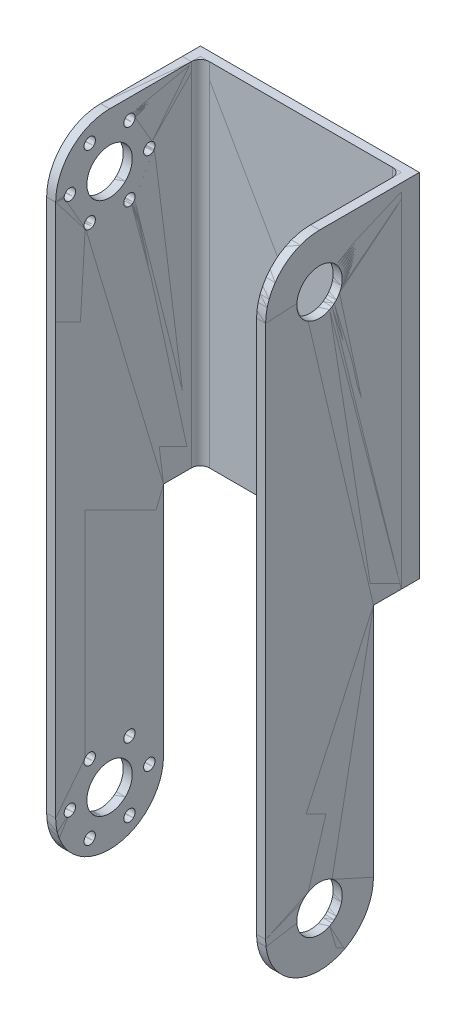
ISO-10303-21;
HEADER;
FILE_DESCRIPTION(('STEP AP214'),'2;1');
FILE_NAME('part.step','',(''),(''),'','','');
FILE_SCHEMA(('AUTOMOTIVE_DESIGN { 1 0 10303 214 1 1 1 1 }'));
ENDSEC;
DATA;
#1=APPLICATION_CONTEXT('core data for automotive mechanical design processes');
#2=APPLICATION_PROTOCOL_DEFINITION('international standard','automotive_design',2000,#1);
#3=PRODUCT_CONTEXT('',#1,'mechanical');
#4=PRODUCT('Part','Part','',(#3));
#5=PRODUCT_RELATED_PRODUCT_CATEGORY('part','',(#4));
#6=PRODUCT_DEFINITION_FORMATION('','',#4);
#7=PRODUCT_DEFINITION_CONTEXT('part definition',#1,'design');
#8=PRODUCT_DEFINITION('design','',#6,#7);
#9=PRODUCT_DEFINITION_SHAPE('','',#8);
#10=(LENGTH_UNIT() NAMED_UNIT(*) SI_UNIT(.MILLI.,.METRE.));
#11=(NAMED_UNIT(*) PLANE_ANGLE_UNIT() SI_UNIT($,.RADIAN.));
#12=(NAMED_UNIT(*) SI_UNIT($,.STERADIAN.) SOLID_ANGLE_UNIT());
#13=UNCERTAINTY_MEASURE_WITH_UNIT(LENGTH_MEASURE(1.E-05),#10,'distance_accuracy_value','');
#14=(GEOMETRIC_REPRESENTATION_CONTEXT(3) GLOBAL_UNCERTAINTY_ASSIGNED_CONTEXT((#13)) GLOBAL_UNIT_ASSIGNED_CONTEXT((#10,
#11,#12)) REPRESENTATION_CONTEXT('',''));
#15=CARTESIAN_POINT('',(0.,0.,0.));
#16=DIRECTION('',(0.,0.,1.));
#17=DIRECTION('',(1.,0.,0.));
#18=AXIS2_PLACEMENT_3D('',#15,#16,#17);
#19=CARTESIAN_POINT('',(-16.8,31.,0.));
#20=DIRECTION('',(0.,1.,0.));
#21=DIRECTION('',(1.,0.,0.));
#22=AXIS2_PLACEMENT_3D('',#19,#20,#21);
#23=PLANE('',#22);
#24=DIRECTION('',(0.,0.,-1.));
#25=VECTOR('',#24,1.);
#26=CARTESIAN_POINT('',(-15.2125,31.,0.));
#27=LINE('',#26,#25);
#28=CARTESIAN_POINT('',(-15.2125,31.,1.5875));
#29=VERTEX_POINT('',#28);
#30=CARTESIAN_POINT('',(-15.2125,31.,0.));
#31=VERTEX_POINT('',#30);
#32=EDGE_CURVE('E12',#29,#31,#27,.T.);
#33=ORIENTED_EDGE('',*,*,#32,.F.);
#34=DIRECTION('',(-1.,0.,0.));
#35=VECTOR('',#34,1.);
#36=CARTESIAN_POINT('',(0.,31.,1.5875));
#37=LINE('',#36,#35);
#38=CARTESIAN_POINT('',(17.0125,31.,1.5875));
#39=VERTEX_POINT('',#38);
#40=EDGE_CURVE('E128',#29,#39,#37,.F.);
#41=ORIENTED_EDGE('',*,*,#40,.T.);
#42=DIRECTION('',(0.,0.,-1.));
#43=VECTOR('',#42,1.);
#44=CARTESIAN_POINT('',(17.0125,31.,0.));
#45=LINE('',#44,#43);
#46=CARTESIAN_POINT('',(17.0125,31.,0.));
#47=VERTEX_POINT('',#46);
#48=EDGE_CURVE('E63',#39,#47,#45,.T.);
#49=ORIENTED_EDGE('',*,*,#48,.T.);
#50=DIRECTION('',(1.,0.,0.));
#51=VECTOR('',#50,1.);
#52=CARTESIAN_POINT('',(-16.8,31.,0.));
#53=LINE('',#52,#51);
#54=EDGE_CURVE('E130',#31,#47,#53,.T.);
#55=ORIENTED_EDGE('',*,*,#54,.F.);
#56=EDGE_LOOP('',(#33,#41,#49,#55));
#57=FACE_BOUND('',#56,.T.);
#58=ADVANCED_FACE('F53',(#57),#23,.T.);
#59=CARTESIAN_POINT('',(17.0125,31.,3.175));
#60=DIRECTION('',(0.,1.,0.));
#61=DIRECTION('',(0.,0.,1.));
#62=AXIS2_PLACEMENT_3D('',#59,#60,#61);
#63=PLANE('',#62);
#64=ORIENTED_EDGE('',*,*,#48,.F.);
#65=CARTESIAN_POINT('',(17.0125,31.,3.175));
#66=DIRECTION('',(0.,1.,0.));
#67=DIRECTION('',(0.,0.,1.));
#68=AXIS2_PLACEMENT_3D('',#65,#66,#67);
#69=CIRCLE('',#68,1.5875);
#70=CARTESIAN_POINT('',(18.6,31.,3.175));
#71=VERTEX_POINT('',#70);
#72=EDGE_CURVE('E229',#39,#71,#69,.F.);
#73=ORIENTED_EDGE('',*,*,#72,.T.);
#74=DIRECTION('',(1.,0.,0.));
#75=VECTOR('',#74,1.);
#76=CARTESIAN_POINT('',(20.1875,31.,3.175));
#77=LINE('',#76,#75);
#78=CARTESIAN_POINT('',(20.1875,31.,3.175));
#79=VERTEX_POINT('',#78);
#80=EDGE_CURVE('E218',#71,#79,#77,.T.);
#81=ORIENTED_EDGE('',*,*,#80,.T.);
#82=CARTESIAN_POINT('',(17.0125,31.,3.175));
#83=DIRECTION('',(0.,-1.,0.));
#84=DIRECTION('',(0.,0.,-1.));
#85=AXIS2_PLACEMENT_3D('',#82,#83,#84);
#86=CIRCLE('',#85,3.175);
#87=EDGE_CURVE('E227',#47,#79,#86,.T.);
#88=ORIENTED_EDGE('',*,*,#87,.F.);
#89=EDGE_LOOP('',(#64,#73,#81,#88));
#90=FACE_BOUND('',#89,.T.);
#91=ADVANCED_FACE('F226',(#90),#63,.T.);
#92=CARTESIAN_POINT('',(20.1875,31.,0.));
#93=DIRECTION('',(0.,-1.,0.));
#94=DIRECTION('',(0.,0.,-1.));
#95=AXIS2_PLACEMENT_3D('',#92,#93,#94);
#96=PLANE('',#95);
#97=ORIENTED_EDGE('',*,*,#80,.F.);
#98=DIRECTION('',(0.,0.,-1.));
#99=VECTOR('',#98,1.);
#100=CARTESIAN_POINT('',(18.6,31.,0.));
#101=LINE('',#100,#99);
#102=CARTESIAN_POINT('',(18.6,31.,17.5875));
#103=VERTEX_POINT('',#102);
#104=EDGE_CURVE('E176',#103,#71,#101,.T.);
#105=ORIENTED_EDGE('',*,*,#104,.F.);
#106=DIRECTION('',(1.,0.,0.));
#107=VECTOR('',#106,1.);
#108=CARTESIAN_POINT('',(20.1875,31.,17.5875));
#109=LINE('',#108,#107);
#110=CARTESIAN_POINT('',(20.1875,31.,17.5875));
#111=VERTEX_POINT('',#110);
#112=EDGE_CURVE('E215',#103,#111,#109,.T.);
#113=ORIENTED_EDGE('',*,*,#112,.T.);
#114=DIRECTION('',(0.,0.,-1.));
#115=VECTOR('',#114,1.);
#116=CARTESIAN_POINT('',(20.1875,31.,0.));
#117=LINE('',#116,#115);
#118=EDGE_CURVE('E246',#111,#79,#117,.T.);
#119=ORIENTED_EDGE('',*,*,#118,.T.);
#120=EDGE_LOOP('',(#97,#105,#113,#119));
#121=FACE_BOUND('',#120,.T.);
#122=ADVANCED_FACE('F247',(#121),#96,.F.);
#123=CARTESIAN_POINT('',(20.1875,21.5,17.5875));
#124=DIRECTION('',(1.,0.,0.));
#125=DIRECTION('',(0.,0.,-1.));
#126=AXIS2_PLACEMENT_3D('',#123,#124,#125);
#127=CYLINDRICAL_SURFACE('',#126,9.5);
#128=ORIENTED_EDGE('',*,*,#112,.F.);
#129=CARTESIAN_POINT('',(18.6,21.5,17.5875));
#130=DIRECTION('',(1.,0.,0.));
#131=DIRECTION('',(0.,0.,-1.));
#132=AXIS2_PLACEMENT_3D('',#129,#130,#131);
#133=CIRCLE('',#132,9.5);
#134=CARTESIAN_POINT('',(18.6,21.5,27.0875));
#135=VERTEX_POINT('',#134);
#136=EDGE_CURVE('E348',#103,#135,#133,.T.);
#137=ORIENTED_EDGE('',*,*,#136,.T.);
#138=DIRECTION('',(1.,0.,0.));
#139=VECTOR('',#138,1.);
#140=CARTESIAN_POINT('',(20.1875,21.5,27.0875));
#141=LINE('',#140,#139);
#142=CARTESIAN_POINT('',(20.1875,21.5,27.0875));
#143=VERTEX_POINT('',#142);
#144=EDGE_CURVE('E212',#135,#143,#141,.T.);
#145=ORIENTED_EDGE('',*,*,#144,.T.);
#146=CARTESIAN_POINT('',(20.1875,21.5,17.5875));
#147=DIRECTION('',(1.,0.,0.));
#148=DIRECTION('',(0.,0.,-1.));
#149=AXIS2_PLACEMENT_3D('',#146,#147,#148);
#150=CIRCLE('',#149,9.5);
#151=EDGE_CURVE('E251',#111,#143,#150,.T.);
#152=ORIENTED_EDGE('',*,*,#151,.F.);
#153=EDGE_LOOP('',(#128,#137,#145,#152));
#154=FACE_BOUND('',#153,.T.);
#155=ADVANCED_FACE('F361',(#154),#127,.T.);
#156=CARTESIAN_POINT('',(20.1875,0.,27.0875));
#157=DIRECTION('',(0.,0.,-1.));
#158=DIRECTION('',(0.,1.,0.));
#159=AXIS2_PLACEMENT_3D('',#156,#157,#158);
#160=PLANE('',#159);
#161=ORIENTED_EDGE('',*,*,#144,.F.);
#162=DIRECTION('',(0.,1.,0.));
#163=VECTOR('',#162,1.);
#164=CARTESIAN_POINT('',(18.6,0.,27.0875));
#165=LINE('',#164,#163);
#166=CARTESIAN_POINT('',(18.6,-72.5,27.0875));
#167=VERTEX_POINT('',#166);
#168=EDGE_CURVE('E345',#167,#135,#165,.T.);
#169=ORIENTED_EDGE('',*,*,#168,.F.);
#170=DIRECTION('',(1.,0.,0.));
#171=VECTOR('',#170,1.);
#172=CARTESIAN_POINT('',(20.1875,-72.5,27.0875));
#173=LINE('',#172,#171);
#174=CARTESIAN_POINT('',(20.1875,-72.5,27.0875));
#175=VERTEX_POINT('',#174);
#176=EDGE_CURVE('E209',#167,#175,#173,.T.);
#177=ORIENTED_EDGE('',*,*,#176,.T.);
#178=DIRECTION('',(0.,1.,0.));
#179=VECTOR('',#178,1.);
#180=CARTESIAN_POINT('',(20.1875,0.,27.0875));
#181=LINE('',#180,#179);
#182=EDGE_CURVE('E366',#175,#143,#181,.T.);
#183=ORIENTED_EDGE('',*,*,#182,.T.);
#184=EDGE_LOOP('',(#161,#169,#177,#183));
#185=FACE_BOUND('',#184,.T.);
#186=ADVANCED_FACE('F609',(#185),#160,.F.);
#187=CARTESIAN_POINT('',(20.1875,-72.5,17.5875));
#188=DIRECTION('',(1.,0.,0.));
#189=DIRECTION('',(0.,0.,-1.));
#190=AXIS2_PLACEMENT_3D('',#187,#188,#189);
#191=CYLINDRICAL_SURFACE('',#190,9.50000000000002);
#192=ORIENTED_EDGE('',*,*,#176,.F.);
#193=CARTESIAN_POINT('',(18.6,-72.5,17.5875));
#194=DIRECTION('',(1.,0.,0.));
#195=DIRECTION('',(0.,0.,-1.));
#196=AXIS2_PLACEMENT_3D('',#193,#194,#195);
#197=CIRCLE('',#196,9.50000000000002);
#198=CARTESIAN_POINT('',(18.6,-72.5,8.08749999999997));
#199=VERTEX_POINT('',#198);
#200=EDGE_CURVE('E342',#167,#199,#197,.T.);
#201=ORIENTED_EDGE('',*,*,#200,.T.);
#202=DIRECTION('',(1.,0.,0.));
#203=VECTOR('',#202,1.);
#204=CARTESIAN_POINT('',(20.1875,-72.5,8.08749999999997));
#205=LINE('',#204,#203);
#206=CARTESIAN_POINT('',(20.1875,-72.5,8.08749999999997));
#207=VERTEX_POINT('',#206);
#208=EDGE_CURVE('E206',#199,#207,#205,.T.);
#209=ORIENTED_EDGE('',*,*,#208,.T.);
#210=CARTESIAN_POINT('',(20.1875,-72.5,17.5875));
#211=DIRECTION('',(1.,0.,0.));
#212=DIRECTION('',(0.,0.,-1.));
#213=AXIS2_PLACEMENT_3D('',#210,#211,#212);
#214=CIRCLE('',#213,9.50000000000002);
#215=EDGE_CURVE('E368',#175,#207,#214,.T.);
#216=ORIENTED_EDGE('',*,*,#215,.F.);
#217=EDGE_LOOP('',(#192,#201,#209,#216));
#218=FACE_BOUND('',#217,.T.);
#219=ADVANCED_FACE('F605',(#218),#191,.T.);
#220=CARTESIAN_POINT('',(20.1875,0.,8.08750000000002));
#221=DIRECTION('',(0.,0.,-1.));
#222=DIRECTION('',(0.,1.,0.));
#223=AXIS2_PLACEMENT_3D('',#220,#221,#222);
#224=PLANE('',#223);
#225=ORIENTED_EDGE('',*,*,#208,.F.);
#226=DIRECTION('',(0.,1.,0.));
#227=VECTOR('',#226,1.);
#228=CARTESIAN_POINT('',(18.6,0.,8.08749999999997));
#229=LINE('',#228,#227);
#230=CARTESIAN_POINT('',(18.6,-31.,8.0875));
#231=VERTEX_POINT('',#230);
#232=EDGE_CURVE('E339',#199,#231,#229,.T.);
#233=ORIENTED_EDGE('',*,*,#232,.T.);
#234=DIRECTION('',(1.,0.,0.));
#235=VECTOR('',#234,1.);
#236=CARTESIAN_POINT('',(20.1875,-31.,8.0875));
#237=LINE('',#236,#235);
#238=CARTESIAN_POINT('',(20.1875,-31.,8.0875));
#239=VERTEX_POINT('',#238);
#240=EDGE_CURVE('E203',#231,#239,#237,.T.);
#241=ORIENTED_EDGE('',*,*,#240,.T.);
#242=DIRECTION('',(0.,1.,0.));
#243=VECTOR('',#242,1.);
#244=CARTESIAN_POINT('',(20.1875,0.,8.08750000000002));
#245=LINE('',#244,#243);
#246=EDGE_CURVE('E374',#207,#239,#245,.T.);
#247=ORIENTED_EDGE('',*,*,#246,.F.);
#248=EDGE_LOOP('',(#225,#233,#241,#247));
#249=FACE_BOUND('',#248,.T.);
#250=ADVANCED_FACE('F601',(#249),#224,.T.);
#251=CARTESIAN_POINT('',(20.1875,-31.,0.));
#252=DIRECTION('',(0.,-1.,0.));
#253=DIRECTION('',(0.,0.,-1.));
#254=AXIS2_PLACEMENT_3D('',#251,#252,#253);
#255=PLANE('',#254);
#256=ORIENTED_EDGE('',*,*,#240,.F.);
#257=DIRECTION('',(0.,0.,-1.));
#258=VECTOR('',#257,1.);
#259=CARTESIAN_POINT('',(18.6,-31.,0.));
#260=LINE('',#259,#258);
#261=CARTESIAN_POINT('',(18.6,-31.,3.175));
#262=VERTEX_POINT('',#261);
#263=EDGE_CURVE('E334',#231,#262,#260,.T.);
#264=ORIENTED_EDGE('',*,*,#263,.T.);
#265=DIRECTION('',(1.,0.,0.));
#266=VECTOR('',#265,1.);
#267=CARTESIAN_POINT('',(20.1875,-31.,3.175));
#268=LINE('',#267,#266);
#269=CARTESIAN_POINT('',(20.1875,-31.,3.175));
#270=VERTEX_POINT('',#269);
#271=EDGE_CURVE('E200',#262,#270,#268,.T.);
#272=ORIENTED_EDGE('',*,*,#271,.T.);
#273=DIRECTION('',(0.,0.,-1.));
#274=VECTOR('',#273,1.);
#275=CARTESIAN_POINT('',(20.1875,-31.,0.));
#276=LINE('',#275,#274);
#277=EDGE_CURVE('E258',#239,#270,#276,.T.);
#278=ORIENTED_EDGE('',*,*,#277,.F.);
#279=EDGE_LOOP('',(#256,#264,#272,#278));
#280=FACE_BOUND('',#279,.T.);
#281=ADVANCED_FACE('F597',(#280),#255,.T.);
#282=CARTESIAN_POINT('',(17.0125,-31.,3.175));
#283=DIRECTION('',(0.,-1.,0.));
#284=DIRECTION('',(0.,0.,-1.));
#285=AXIS2_PLACEMENT_3D('',#282,#283,#284);
#286=PLANE('',#285);
#287=ORIENTED_EDGE('',*,*,#271,.F.);
#288=CARTESIAN_POINT('',(17.0125,-31.,3.175));
#289=DIRECTION('',(0.,1.,0.));
#290=DIRECTION('',(0.,0.,1.));
#291=AXIS2_PLACEMENT_3D('',#288,#289,#290);
#292=CIRCLE('',#291,1.5875);
#293=CARTESIAN_POINT('',(17.0125,-31.,1.5875));
#294=VERTEX_POINT('',#293);
#295=EDGE_CURVE('E170',#262,#294,#292,.T.);
#296=ORIENTED_EDGE('',*,*,#295,.T.);
#297=DIRECTION('',(0.,0.,-1.));
#298=VECTOR('',#297,1.);
#299=CARTESIAN_POINT('',(17.0125,-31.,0.));
#300=LINE('',#299,#298);
#301=CARTESIAN_POINT('',(17.0125,-31.,0.));
#302=VERTEX_POINT('',#301);
#303=EDGE_CURVE('E198',#294,#302,#300,.T.);
#304=ORIENTED_EDGE('',*,*,#303,.T.);
#305=CARTESIAN_POINT('',(17.0125,-31.,3.175));
#306=DIRECTION('',(0.,1.,0.));
#307=DIRECTION('',(0.,0.,1.));
#308=AXIS2_PLACEMENT_3D('',#305,#306,#307);
#309=CIRCLE('',#308,3.175);
#310=EDGE_CURVE('E243',#270,#302,#309,.T.);
#311=ORIENTED_EDGE('',*,*,#310,.F.);
#312=EDGE_LOOP('',(#287,#296,#304,#311));
#313=FACE_BOUND('',#312,.T.);
#314=ADVANCED_FACE('F593',(#313),#286,.T.);
#315=CARTESIAN_POINT('',(-16.8,-31.,0.));
#316=DIRECTION('',(0.,1.,0.));
#317=DIRECTION('',(1.,0.,0.));
#318=AXIS2_PLACEMENT_3D('',#315,#316,#317);
#319=PLANE('',#318);
#320=ORIENTED_EDGE('',*,*,#303,.F.);
#321=DIRECTION('',(-1.,0.,0.));
#322=VECTOR('',#321,1.);
#323=CARTESIAN_POINT('',(0.,-31.,1.5875));
#324=LINE('',#323,#322);
#325=CARTESIAN_POINT('',(-15.2125,-31.,1.5875));
#326=VERTEX_POINT('',#325);
#327=EDGE_CURVE('E159',#326,#294,#324,.F.);
#328=ORIENTED_EDGE('',*,*,#327,.F.);
#329=DIRECTION('',(0.,0.,-1.));
#330=VECTOR('',#329,1.);
#331=CARTESIAN_POINT('',(-15.2125,-31.,0.));
#332=LINE('',#331,#330);
#333=CARTESIAN_POINT('',(-15.2125,-31.,0.));
#334=VERTEX_POINT('',#333);
#335=EDGE_CURVE('E195',#326,#334,#332,.T.);
#336=ORIENTED_EDGE('',*,*,#335,.T.);
#337=DIRECTION('',(1.,0.,0.));
#338=VECTOR('',#337,1.);
#339=CARTESIAN_POINT('',(-16.8,-31.,0.));
#340=LINE('',#339,#338);
#341=EDGE_CURVE('E377',#334,#302,#340,.T.);
#342=ORIENTED_EDGE('',*,*,#341,.T.);
#343=EDGE_LOOP('',(#320,#328,#336,#342));
#344=FACE_BOUND('',#343,.T.);
#345=ADVANCED_FACE('F589',(#344),#319,.F.);
#346=CARTESIAN_POINT('',(-15.2125,-31.,3.175));
#347=DIRECTION('',(0.,-1.,0.));
#348=DIRECTION('',(0.,0.,-1.));
#349=AXIS2_PLACEMENT_3D('',#346,#347,#348);
#350=PLANE('',#349);
#351=ORIENTED_EDGE('',*,*,#335,.F.);
#352=CARTESIAN_POINT('',(-15.2125,-31.,3.175));
#353=DIRECTION('',(0.,-1.,0.));
#354=DIRECTION('',(0.,0.,-1.));
#355=AXIS2_PLACEMENT_3D('',#352,#353,#354);
#356=CIRCLE('',#355,1.5875);
#357=CARTESIAN_POINT('',(-16.8,-31.,3.175));
#358=VERTEX_POINT('',#357);
#359=EDGE_CURVE('E146',#326,#358,#356,.F.);
#360=ORIENTED_EDGE('',*,*,#359,.T.);
#361=DIRECTION('',(-1.,0.,0.));
#362=VECTOR('',#361,1.);
#363=CARTESIAN_POINT('',(-18.3875,-31.,3.175));
#364=LINE('',#363,#362);
#365=CARTESIAN_POINT('',(-18.3875,-31.,3.175));
#366=VERTEX_POINT('',#365);
#367=EDGE_CURVE('E192',#358,#366,#364,.T.);
#368=ORIENTED_EDGE('',*,*,#367,.T.);
#369=CARTESIAN_POINT('',(-15.2125,-31.,3.175));
#370=DIRECTION('',(0.,1.,0.));
#371=DIRECTION('',(0.,0.,1.));
#372=AXIS2_PLACEMENT_3D('',#369,#370,#371);
#373=CIRCLE('',#372,3.175);
#374=EDGE_CURVE('E270',#334,#366,#373,.T.);
#375=ORIENTED_EDGE('',*,*,#374,.F.);
#376=EDGE_LOOP('',(#351,#360,#368,#375));
#377=FACE_BOUND('',#376,.T.);
#378=ADVANCED_FACE('F585',(#377),#350,.T.);
#379=CARTESIAN_POINT('',(-18.3875,-31.,0.));
#380=DIRECTION('',(0.,-1.,0.));
#381=DIRECTION('',(0.,0.,1.));
#382=AXIS2_PLACEMENT_3D('',#379,#380,#381);
#383=PLANE('',#382);
#384=ORIENTED_EDGE('',*,*,#367,.F.);
#385=DIRECTION('',(0.,0.,1.));
#386=VECTOR('',#385,1.);
#387=CARTESIAN_POINT('',(-16.8,-31.,0.));
#388=LINE('',#387,#386);
#389=CARTESIAN_POINT('',(-16.8,-31.,8.0875));
#390=VERTEX_POINT('',#389);
#391=EDGE_CURVE('E320',#358,#390,#388,.T.);
#392=ORIENTED_EDGE('',*,*,#391,.T.);
#393=DIRECTION('',(-1.,0.,0.));
#394=VECTOR('',#393,1.);
#395=CARTESIAN_POINT('',(-18.3875,-31.,8.0875));
#396=LINE('',#395,#394);
#397=CARTESIAN_POINT('',(-18.3875,-31.,8.0875));
#398=VERTEX_POINT('',#397);
#399=EDGE_CURVE('E189',#390,#398,#396,.T.);
#400=ORIENTED_EDGE('',*,*,#399,.T.);
#401=DIRECTION('',(0.,0.,1.));
#402=VECTOR('',#401,1.);
#403=CARTESIAN_POINT('',(-18.3875,-31.,0.));
#404=LINE('',#403,#402);
#405=EDGE_CURVE('E432',#366,#398,#404,.T.);
#406=ORIENTED_EDGE('',*,*,#405,.F.);
#407=EDGE_LOOP('',(#384,#392,#400,#406));
#408=FACE_BOUND('',#407,.T.);
#409=ADVANCED_FACE('F581',(#408),#383,.T.);
#410=CARTESIAN_POINT('',(-18.3875,0.,8.0875));
#411=DIRECTION('',(0.,0.,1.));
#412=DIRECTION('',(0.,1.,0.));
#413=AXIS2_PLACEMENT_3D('',#410,#411,#412);
#414=PLANE('',#413);
#415=ORIENTED_EDGE('',*,*,#399,.F.);
#416=DIRECTION('',(0.,1.,0.));
#417=VECTOR('',#416,1.);
#418=CARTESIAN_POINT('',(-16.8,0.,8.0875));
#419=LINE('',#418,#417);
#420=CARTESIAN_POINT('',(-16.8,-72.5,8.0875));
#421=VERTEX_POINT('',#420);
#422=EDGE_CURVE('E328',#421,#390,#419,.T.);
#423=ORIENTED_EDGE('',*,*,#422,.F.);
#424=DIRECTION('',(-1.,0.,0.));
#425=VECTOR('',#424,1.);
#426=CARTESIAN_POINT('',(-18.3875,-72.5,8.0875));
#427=LINE('',#426,#425);
#428=CARTESIAN_POINT('',(-18.3875,-72.5,8.0875));
#429=VERTEX_POINT('',#428);
#430=EDGE_CURVE('E186',#421,#429,#427,.T.);
#431=ORIENTED_EDGE('',*,*,#430,.T.);
#432=DIRECTION('',(0.,1.,0.));
#433=VECTOR('',#432,1.);
#434=CARTESIAN_POINT('',(-18.3875,0.,8.0875));
#435=LINE('',#434,#433);
#436=EDGE_CURVE('E435',#429,#398,#435,.T.);
#437=ORIENTED_EDGE('',*,*,#436,.T.);
#438=EDGE_LOOP('',(#415,#423,#431,#437));
#439=FACE_BOUND('',#438,.T.);
#440=ADVANCED_FACE('F577',(#439),#414,.F.);
#441=CARTESIAN_POINT('',(-18.3875,-72.5,17.5875));
#442=DIRECTION('',(-1.,0.,0.));
#443=DIRECTION('',(0.,0.,1.));
#444=AXIS2_PLACEMENT_3D('',#441,#442,#443);
#445=CYLINDRICAL_SURFACE('',#444,9.5);
#446=ORIENTED_EDGE('',*,*,#430,.F.);
#447=CARTESIAN_POINT('',(-16.8,-72.5,17.5875));
#448=DIRECTION('',(-1.,0.,0.));
#449=DIRECTION('',(0.,0.,1.));
#450=AXIS2_PLACEMENT_3D('',#447,#448,#449);
#451=CIRCLE('',#450,9.5);
#452=CARTESIAN_POINT('',(-16.8,-72.5,27.0875));
#453=VERTEX_POINT('',#452);
#454=EDGE_CURVE('E271',#453,#421,#451,.F.);
#455=ORIENTED_EDGE('',*,*,#454,.F.);
#456=DIRECTION('',(-1.,0.,0.));
#457=VECTOR('',#456,1.);
#458=CARTESIAN_POINT('',(-18.3875,-72.5,27.0875));
#459=LINE('',#458,#457);
#460=CARTESIAN_POINT('',(-18.3875,-72.5,27.0875));
#461=VERTEX_POINT('',#460);
#462=EDGE_CURVE('E183',#453,#461,#459,.T.);
#463=ORIENTED_EDGE('',*,*,#462,.T.);
#464=CARTESIAN_POINT('',(-18.3875,-72.5,17.5875));
#465=DIRECTION('',(-1.,0.,0.));
#466=DIRECTION('',(0.,0.,1.));
#467=AXIS2_PLACEMENT_3D('',#464,#465,#466);
#468=CIRCLE('',#467,9.5);
#469=EDGE_CURVE('E438',#461,#429,#468,.F.);
#470=ORIENTED_EDGE('',*,*,#469,.T.);
#471=EDGE_LOOP('',(#446,#455,#463,#470));
#472=FACE_BOUND('',#471,.T.);
#473=ADVANCED_FACE('F573',(#472),#445,.T.);
#474=CARTESIAN_POINT('',(-18.3875,0.,27.0875));
#475=DIRECTION('',(0.,0.,-1.));
#476=DIRECTION('',(0.,-1.,0.));
#477=AXIS2_PLACEMENT_3D('',#474,#475,#476);
#478=PLANE('',#477);
#479=ORIENTED_EDGE('',*,*,#462,.F.);
#480=DIRECTION('',(0.,1.,0.));
#481=VECTOR('',#480,1.);
#482=CARTESIAN_POINT('',(-16.8,0.,27.0875));
#483=LINE('',#482,#481);
#484=CARTESIAN_POINT('',(-16.8,21.5,27.0875));
#485=VERTEX_POINT('',#484);
#486=EDGE_CURVE('E316',#485,#453,#483,.F.);
#487=ORIENTED_EDGE('',*,*,#486,.F.);
#488=DIRECTION('',(-1.,0.,0.));
#489=VECTOR('',#488,1.);
#490=CARTESIAN_POINT('',(-18.3875,21.5,27.0875));
#491=LINE('',#490,#489);
#492=CARTESIAN_POINT('',(-18.3875,21.5,27.0875));
#493=VERTEX_POINT('',#492);
#494=EDGE_CURVE('E180',#485,#493,#491,.T.);
#495=ORIENTED_EDGE('',*,*,#494,.T.);
#496=DIRECTION('',(0.,-1.,0.));
#497=VECTOR('',#496,1.);
#498=CARTESIAN_POINT('',(-18.3875,0.,27.0875));
#499=LINE('',#498,#497);
#500=EDGE_CURVE('E423',#493,#461,#499,.T.);
#501=ORIENTED_EDGE('',*,*,#500,.T.);
#502=EDGE_LOOP('',(#479,#487,#495,#501));
#503=FACE_BOUND('',#502,.T.);
#504=ADVANCED_FACE('F569',(#503),#478,.F.);
#505=CARTESIAN_POINT('',(-18.3875,21.5,17.5875));
#506=DIRECTION('',(-1.,0.,0.));
#507=DIRECTION('',(0.,0.,1.));
#508=AXIS2_PLACEMENT_3D('',#505,#506,#507);
#509=CYLINDRICAL_SURFACE('',#508,9.5);
#510=ORIENTED_EDGE('',*,*,#494,.F.);
#511=CARTESIAN_POINT('',(-16.8,21.5,17.5875));
#512=DIRECTION('',(-1.,0.,0.));
#513=DIRECTION('',(0.,0.,1.));
#514=AXIS2_PLACEMENT_3D('',#511,#512,#513);
#515=CIRCLE('',#514,9.5);
#516=CARTESIAN_POINT('',(-16.8,31.,17.5875));
#517=VERTEX_POINT('',#516);
#518=EDGE_CURVE('E321',#485,#517,#515,.T.);
#519=ORIENTED_EDGE('',*,*,#518,.T.);
#520=DIRECTION('',(-1.,0.,0.));
#521=VECTOR('',#520,1.);
#522=CARTESIAN_POINT('',(-18.3875,31.,17.5875));
#523=LINE('',#522,#521);
#524=CARTESIAN_POINT('',(-18.3875,31.,17.5875));
#525=VERTEX_POINT('',#524);
#526=EDGE_CURVE('E177',#517,#525,#523,.T.);
#527=ORIENTED_EDGE('',*,*,#526,.T.);
#528=CARTESIAN_POINT('',(-18.3875,21.5,17.5875));
#529=DIRECTION('',(-1.,0.,0.));
#530=DIRECTION('',(0.,0.,1.));
#531=AXIS2_PLACEMENT_3D('',#528,#529,#530);
#532=CIRCLE('',#531,9.5);
#533=EDGE_CURVE('E426',#493,#525,#532,.T.);
#534=ORIENTED_EDGE('',*,*,#533,.F.);
#535=EDGE_LOOP('',(#510,#519,#527,#534));
#536=FACE_BOUND('',#535,.T.);
#537=ADVANCED_FACE('F490',(#536),#509,.T.);
#538=CARTESIAN_POINT('',(-18.3875,31.,0.));
#539=DIRECTION('',(0.,-1.,0.));
#540=DIRECTION('',(0.,0.,1.));
#541=AXIS2_PLACEMENT_3D('',#538,#539,#540);
#542=PLANE('',#541);
#543=ORIENTED_EDGE('',*,*,#526,.F.);
#544=DIRECTION('',(0.,0.,1.));
#545=VECTOR('',#544,1.);
#546=CARTESIAN_POINT('',(-16.8,31.,0.));
#547=LINE('',#546,#545);
#548=CARTESIAN_POINT('',(-16.8,31.,3.175));
#549=VERTEX_POINT('',#548);
#550=EDGE_CURVE('E317',#549,#517,#547,.T.);
#551=ORIENTED_EDGE('',*,*,#550,.F.);
#552=DIRECTION('',(-1.,0.,0.));
#553=VECTOR('',#552,1.);
#554=CARTESIAN_POINT('',(-18.3875,31.,3.175));
#555=LINE('',#554,#553);
#556=CARTESIAN_POINT('',(-18.3875,31.,3.175));
#557=VERTEX_POINT('',#556);
#558=EDGE_CURVE('E57',#549,#557,#555,.T.);
#559=ORIENTED_EDGE('',*,*,#558,.T.);
#560=DIRECTION('',(0.,0.,1.));
#561=VECTOR('',#560,1.);
#562=CARTESIAN_POINT('',(-18.3875,31.,0.));
#563=LINE('',#562,#561);
#564=EDGE_CURVE('E429',#557,#525,#563,.T.);
#565=ORIENTED_EDGE('',*,*,#564,.T.);
#566=EDGE_LOOP('',(#543,#551,#559,#565));
#567=FACE_BOUND('',#566,.T.);
#568=ADVANCED_FACE('F484',(#567),#542,.F.);
#569=CARTESIAN_POINT('',(20.1875,21.55,17.5875));
#570=DIRECTION('',(1.,0.,0.));
#571=DIRECTION('',(0.,0.,-1.));
#572=AXIS2_PLACEMENT_3D('',#569,#570,#571);
#573=CYLINDRICAL_SURFACE('',#572,4.);
#574=CARTESIAN_POINT('',(20.1875,21.55,17.5875));
#575=DIRECTION('',(1.,0.,0.));
#576=DIRECTION('',(0.,0.,-1.));
#577=AXIS2_PLACEMENT_3D('',#574,#575,#576);
#578=CIRCLE('',#577,4.);
#579=CARTESIAN_POINT('',(20.1875,21.55,13.5875));
#580=VERTEX_POINT('',#579);
#581=EDGE_CURVE('E449',#580,#580,#578,.T.);
#582=ORIENTED_EDGE('',*,*,#581,.T.);
#583=EDGE_LOOP('',(#582));
#584=FACE_BOUND('',#583,.T.);
#585=CARTESIAN_POINT('',(18.6,21.55,17.5875));
#586=DIRECTION('',(1.,0.,0.));
#587=DIRECTION('',(0.,0.,-1.));
#588=AXIS2_PLACEMENT_3D('',#585,#586,#587);
#589=CIRCLE('',#588,4.);
#590=CARTESIAN_POINT('',(18.6,21.55,13.5875));
#591=VERTEX_POINT('',#590);
#592=EDGE_CURVE('E165',#591,#591,#589,.T.);
#593=ORIENTED_EDGE('',*,*,#592,.F.);
#594=EDGE_LOOP('',(#593));
#595=FACE_BOUND('',#594,.T.);
#596=ADVANCED_FACE('F482',(#584,#595),#573,.F.);
#597=CARTESIAN_POINT('',(20.1875,-72.5,17.5875));
#598=DIRECTION('',(1.,0.,0.));
#599=DIRECTION('',(0.,0.,-1.));
#600=AXIS2_PLACEMENT_3D('',#597,#598,#599);
#601=CYLINDRICAL_SURFACE('',#600,4.);
#602=CARTESIAN_POINT('',(20.1875,-72.5,17.5875));
#603=DIRECTION('',(1.,0.,0.));
#604=DIRECTION('',(0.,0.,-1.));
#605=AXIS2_PLACEMENT_3D('',#602,#603,#604);
#606=CIRCLE('',#605,4.);
#607=CARTESIAN_POINT('',(20.1875,-72.5,13.5875));
#608=VERTEX_POINT('',#607);
#609=EDGE_CURVE('E252',#608,#608,#606,.T.);
#610=ORIENTED_EDGE('',*,*,#609,.T.);
#611=EDGE_LOOP('',(#610));
#612=FACE_BOUND('',#611,.T.);
#613=CARTESIAN_POINT('',(18.6,-72.5,17.5875));
#614=DIRECTION('',(1.,0.,0.));
#615=DIRECTION('',(0.,0.,-1.));
#616=AXIS2_PLACEMENT_3D('',#613,#614,#615);
#617=CIRCLE('',#616,4.);
#618=CARTESIAN_POINT('',(18.6,-72.5,13.5875));
#619=VERTEX_POINT('',#618);
#620=EDGE_CURVE('E168',#619,#619,#617,.T.);
#621=ORIENTED_EDGE('',*,*,#620,.F.);
#622=EDGE_LOOP('',(#621));
#623=FACE_BOUND('',#622,.T.);
#624=ADVANCED_FACE('F55',(#612,#623),#601,.F.);
#625=CARTESIAN_POINT('',(-18.3875,15.3777904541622,21.0875));
#626=DIRECTION('',(-1.,0.,0.));
#627=DIRECTION('',(0.,0.,1.));
#628=AXIS2_PLACEMENT_3D('',#625,#626,#627);
#629=CYLINDRICAL_SURFACE('',#628,1.);
#630=CARTESIAN_POINT('',(-18.3875,15.3777904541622,21.0875));
#631=DIRECTION('',(-1.,0.,0.));
#632=DIRECTION('',(0.,0.,1.));
#633=AXIS2_PLACEMENT_3D('',#630,#631,#632);
#634=CIRCLE('',#633,1.);
#635=CARTESIAN_POINT('',(-18.3875,15.3777904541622,22.0875));
#636=VERTEX_POINT('',#635);
#637=EDGE_CURVE('E381',#636,#636,#634,.T.);
#638=ORIENTED_EDGE('',*,*,#637,.T.);
#639=EDGE_LOOP('',(#638));
#640=FACE_BOUND('',#639,.T.);
#641=CARTESIAN_POINT('',(-16.8,15.3777904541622,21.0875));
#642=DIRECTION('',(-1.,0.,0.));
#643=DIRECTION('',(0.,0.,1.));
#644=AXIS2_PLACEMENT_3D('',#641,#642,#643);
#645=CIRCLE('',#644,1.);
#646=CARTESIAN_POINT('',(-16.8,15.3777904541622,22.0875));
#647=VERTEX_POINT('',#646);
#648=EDGE_CURVE('E158',#647,#647,#645,.T.);
#649=ORIENTED_EDGE('',*,*,#648,.F.);
#650=EDGE_LOOP('',(#649));
#651=FACE_BOUND('',#650,.T.);
#652=ADVANCED_FACE('F489',(#640,#651),#629,.F.);
#653=CARTESIAN_POINT('',(-18.3875,21.4399682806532,24.5875));
#654=DIRECTION('',(-1.,0.,0.));
#655=DIRECTION('',(0.,0.,1.));
#656=AXIS2_PLACEMENT_3D('',#653,#654,#655);
#657=CYLINDRICAL_SURFACE('',#656,0.999999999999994);
#658=CARTESIAN_POINT('',(-18.3875,21.4399682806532,24.5875));
#659=DIRECTION('',(-1.,0.,0.));
#660=DIRECTION('',(0.,0.,1.));
#661=AXIS2_PLACEMENT_3D('',#658,#659,#660);
#662=CIRCLE('',#661,0.999999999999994);
#663=CARTESIAN_POINT('',(-18.3875,21.4399682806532,25.5875));
#664=VERTEX_POINT('',#663);
#665=EDGE_CURVE('E384',#664,#664,#662,.T.);
#666=ORIENTED_EDGE('',*,*,#665,.T.);
#667=EDGE_LOOP('',(#666));
#668=FACE_BOUND('',#667,.T.);
#669=CARTESIAN_POINT('',(-16.8,21.4399682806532,24.5875));
#670=DIRECTION('',(-1.,0.,0.));
#671=DIRECTION('',(0.,0.,1.));
#672=AXIS2_PLACEMENT_3D('',#669,#670,#671);
#673=CIRCLE('',#672,0.999999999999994);
#674=CARTESIAN_POINT('',(-16.8,21.4399682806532,25.5875));
#675=VERTEX_POINT('',#674);
#676=EDGE_CURVE('E277',#675,#675,#673,.T.);
#677=ORIENTED_EDGE('',*,*,#676,.F.);
#678=EDGE_LOOP('',(#677));
#679=FACE_BOUND('',#678,.T.);
#680=ADVANCED_FACE('F515',(#668,#679),#657,.F.);
#681=CARTESIAN_POINT('',(-18.3875,27.5021461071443,21.0875));
#682=DIRECTION('',(-1.,0.,0.));
#683=DIRECTION('',(0.,0.,1.));
#684=AXIS2_PLACEMENT_3D('',#681,#682,#683);
#685=CYLINDRICAL_SURFACE('',#684,1.);
#686=CARTESIAN_POINT('',(-18.3875,27.5021461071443,21.0875));
#687=DIRECTION('',(-1.,0.,0.));
#688=DIRECTION('',(0.,0.,1.));
#689=AXIS2_PLACEMENT_3D('',#686,#687,#688);
#690=CIRCLE('',#689,1.);
#691=CARTESIAN_POINT('',(-18.3875,27.5021461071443,22.0875));
#692=VERTEX_POINT('',#691);
#693=EDGE_CURVE('E387',#692,#692,#690,.T.);
#694=ORIENTED_EDGE('',*,*,#693,.T.);
#695=EDGE_LOOP('',(#694));
#696=FACE_BOUND('',#695,.T.);
#697=CARTESIAN_POINT('',(-16.8,27.5021461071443,21.0875));
#698=DIRECTION('',(-1.,0.,0.));
#699=DIRECTION('',(0.,0.,1.));
#700=AXIS2_PLACEMENT_3D('',#697,#698,#699);
#701=CIRCLE('',#700,1.);
#702=CARTESIAN_POINT('',(-16.8,27.5021461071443,22.0875));
#703=VERTEX_POINT('',#702);
#704=EDGE_CURVE('E280',#703,#703,#701,.T.);
#705=ORIENTED_EDGE('',*,*,#704,.F.);
#706=EDGE_LOOP('',(#705));
#707=FACE_BOUND('',#706,.T.);
#708=ADVANCED_FACE('F519',(#696,#707),#685,.F.);
#709=CARTESIAN_POINT('',(-18.3875,27.5021461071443,14.0875));
#710=DIRECTION('',(-1.,0.,0.));
#711=DIRECTION('',(0.,0.,1.));
#712=AXIS2_PLACEMENT_3D('',#709,#710,#711);
#713=CYLINDRICAL_SURFACE('',#712,1.);
#714=CARTESIAN_POINT('',(-18.3875,27.5021461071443,14.0875));
#715=DIRECTION('',(-1.,0.,0.));
#716=DIRECTION('',(0.,0.,1.));
#717=AXIS2_PLACEMENT_3D('',#714,#715,#716);
#718=CIRCLE('',#717,1.);
#719=CARTESIAN_POINT('',(-18.3875,27.5021461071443,15.0875));
#720=VERTEX_POINT('',#719);
#721=EDGE_CURVE('E390',#720,#720,#718,.T.);
#722=ORIENTED_EDGE('',*,*,#721,.T.);
#723=EDGE_LOOP('',(#722));
#724=FACE_BOUND('',#723,.T.);
#725=CARTESIAN_POINT('',(-16.8,27.5021461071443,14.0875));
#726=DIRECTION('',(-1.,0.,0.));
#727=DIRECTION('',(0.,0.,1.));
#728=AXIS2_PLACEMENT_3D('',#725,#726,#727);
#729=CIRCLE('',#728,1.);
#730=CARTESIAN_POINT('',(-16.8,27.5021461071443,15.0875));
#731=VERTEX_POINT('',#730);
#732=EDGE_CURVE('E283',#731,#731,#729,.T.);
#733=ORIENTED_EDGE('',*,*,#732,.F.);
#734=EDGE_LOOP('',(#733));
#735=FACE_BOUND('',#734,.T.);
#736=ADVANCED_FACE('F523',(#724,#735),#713,.F.);
#737=CARTESIAN_POINT('',(-18.3875,21.4399682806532,10.5875));
#738=DIRECTION('',(-1.,0.,0.));
#739=DIRECTION('',(0.,0.,1.));
#740=AXIS2_PLACEMENT_3D('',#737,#738,#739);
#741=CYLINDRICAL_SURFACE('',#740,1.);
#742=CARTESIAN_POINT('',(-18.3875,21.4399682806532,10.5875));
#743=DIRECTION('',(-1.,0.,0.));
#744=DIRECTION('',(0.,0.,1.));
#745=AXIS2_PLACEMENT_3D('',#742,#743,#744);
#746=CIRCLE('',#745,1.);
#747=CARTESIAN_POINT('',(-18.3875,21.4399682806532,11.5875));
#748=VERTEX_POINT('',#747);
#749=EDGE_CURVE('E393',#748,#748,#746,.T.);
#750=ORIENTED_EDGE('',*,*,#749,.T.);
#751=EDGE_LOOP('',(#750));
#752=FACE_BOUND('',#751,.T.);
#753=CARTESIAN_POINT('',(-16.8,21.4399682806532,10.5875));
#754=DIRECTION('',(-1.,0.,0.));
#755=DIRECTION('',(0.,0.,1.));
#756=AXIS2_PLACEMENT_3D('',#753,#754,#755);
#757=CIRCLE('',#756,1.);
#758=CARTESIAN_POINT('',(-16.8,21.4399682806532,11.5875));
#759=VERTEX_POINT('',#758);
#760=EDGE_CURVE('E286',#759,#759,#757,.T.);
#761=ORIENTED_EDGE('',*,*,#760,.F.);
#762=EDGE_LOOP('',(#761));
#763=FACE_BOUND('',#762,.T.);
#764=ADVANCED_FACE('F527',(#752,#763),#741,.F.);
#765=CARTESIAN_POINT('',(-18.3875,15.3777904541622,14.0875));
#766=DIRECTION('',(-1.,0.,0.));
#767=DIRECTION('',(0.,0.,1.));
#768=AXIS2_PLACEMENT_3D('',#765,#766,#767);
#769=CYLINDRICAL_SURFACE('',#768,1.);
#770=CARTESIAN_POINT('',(-18.3875,15.3777904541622,14.0875));
#771=DIRECTION('',(-1.,0.,0.));
#772=DIRECTION('',(0.,0.,1.));
#773=AXIS2_PLACEMENT_3D('',#770,#771,#772);
#774=CIRCLE('',#773,1.);
#775=CARTESIAN_POINT('',(-18.3875,15.3777904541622,15.0875));
#776=VERTEX_POINT('',#775);
#777=EDGE_CURVE('E396',#776,#776,#774,.T.);
#778=ORIENTED_EDGE('',*,*,#777,.T.);
#779=EDGE_LOOP('',(#778));
#780=FACE_BOUND('',#779,.T.);
#781=CARTESIAN_POINT('',(-16.8,15.3777904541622,14.0875));
#782=DIRECTION('',(-1.,0.,0.));
#783=DIRECTION('',(0.,0.,1.));
#784=AXIS2_PLACEMENT_3D('',#781,#782,#783);
#785=CIRCLE('',#784,1.);
#786=CARTESIAN_POINT('',(-16.8,15.3777904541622,15.0875));
#787=VERTEX_POINT('',#786);
#788=EDGE_CURVE('E289',#787,#787,#785,.T.);
#789=ORIENTED_EDGE('',*,*,#788,.F.);
#790=EDGE_LOOP('',(#789));
#791=FACE_BOUND('',#790,.T.);
#792=ADVANCED_FACE('F531',(#780,#791),#769,.F.);
#793=CARTESIAN_POINT('',(-18.3875,21.4399682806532,17.5875));
#794=DIRECTION('',(-1.,0.,0.));
#795=DIRECTION('',(0.,0.,1.));
#796=AXIS2_PLACEMENT_3D('',#793,#794,#795);
#797=CYLINDRICAL_SURFACE('',#796,4.);
#798=CARTESIAN_POINT('',(-18.3875,21.4399682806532,17.5875));
#799=DIRECTION('',(-1.,0.,0.));
#800=DIRECTION('',(0.,0.,1.));
#801=AXIS2_PLACEMENT_3D('',#798,#799,#800);
#802=CIRCLE('',#801,4.);
#803=CARTESIAN_POINT('',(-18.3875,21.4399682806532,21.5875));
#804=VERTEX_POINT('',#803);
#805=EDGE_CURVE('E399',#804,#804,#802,.T.);
#806=ORIENTED_EDGE('',*,*,#805,.T.);
#807=EDGE_LOOP('',(#806));
#808=FACE_BOUND('',#807,.T.);
#809=CARTESIAN_POINT('',(-16.8,21.4399682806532,17.5875));
#810=DIRECTION('',(-1.,0.,0.));
#811=DIRECTION('',(0.,0.,1.));
#812=AXIS2_PLACEMENT_3D('',#809,#810,#811);
#813=CIRCLE('',#812,4.);
#814=CARTESIAN_POINT('',(-16.8,21.4399682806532,21.5875));
#815=VERTEX_POINT('',#814);
#816=EDGE_CURVE('E292',#815,#815,#813,.T.);
#817=ORIENTED_EDGE('',*,*,#816,.F.);
#818=EDGE_LOOP('',(#817));
#819=FACE_BOUND('',#818,.T.);
#820=ADVANCED_FACE('F535',(#808,#819),#797,.F.);
#821=CARTESIAN_POINT('',(-18.3875,-78.5621778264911,21.0875));
#822=DIRECTION('',(-1.,0.,0.));
#823=DIRECTION('',(0.,0.,1.));
#824=AXIS2_PLACEMENT_3D('',#821,#822,#823);
#825=CYLINDRICAL_SURFACE('',#824,0.999999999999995);
#826=CARTESIAN_POINT('',(-18.3875,-78.5621778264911,21.0875));
#827=DIRECTION('',(-1.,0.,0.));
#828=DIRECTION('',(0.,0.,1.));
#829=AXIS2_PLACEMENT_3D('',#826,#827,#828);
#830=CIRCLE('',#829,0.999999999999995);
#831=CARTESIAN_POINT('',(-18.3875,-78.5621778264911,22.0875));
#832=VERTEX_POINT('',#831);
#833=EDGE_CURVE('E402',#832,#832,#830,.T.);
#834=ORIENTED_EDGE('',*,*,#833,.T.);
#835=EDGE_LOOP('',(#834));
#836=FACE_BOUND('',#835,.T.);
#837=CARTESIAN_POINT('',(-16.8,-78.5621778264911,21.0875));
#838=DIRECTION('',(-1.,0.,0.));
#839=DIRECTION('',(0.,0.,1.));
#840=AXIS2_PLACEMENT_3D('',#837,#838,#839);
#841=CIRCLE('',#840,0.999999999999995);
#842=CARTESIAN_POINT('',(-16.8,-78.5621778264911,22.0875));
#843=VERTEX_POINT('',#842);
#844=EDGE_CURVE('E295',#843,#843,#841,.T.);
#845=ORIENTED_EDGE('',*,*,#844,.F.);
#846=EDGE_LOOP('',(#845));
#847=FACE_BOUND('',#846,.T.);
#848=ADVANCED_FACE('F539',(#836,#847),#825,.F.);
#849=CARTESIAN_POINT('',(-18.3875,-72.5,24.5875));
#850=DIRECTION('',(-1.,0.,0.));
#851=DIRECTION('',(0.,0.,1.));
#852=AXIS2_PLACEMENT_3D('',#849,#850,#851);
#853=CYLINDRICAL_SURFACE('',#852,0.999999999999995);
#854=CARTESIAN_POINT('',(-18.3875,-72.5,24.5875));
#855=DIRECTION('',(-1.,0.,0.));
#856=DIRECTION('',(0.,0.,1.));
#857=AXIS2_PLACEMENT_3D('',#854,#855,#856);
#858=CIRCLE('',#857,0.999999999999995);
#859=CARTESIAN_POINT('',(-18.3875,-72.5,25.5875));
#860=VERTEX_POINT('',#859);
#861=EDGE_CURVE('E405',#860,#860,#858,.T.);
#862=ORIENTED_EDGE('',*,*,#861,.T.);
#863=EDGE_LOOP('',(#862));
#864=FACE_BOUND('',#863,.T.);
#865=CARTESIAN_POINT('',(-16.8,-72.5,24.5875));
#866=DIRECTION('',(-1.,0.,0.));
#867=DIRECTION('',(0.,0.,1.));
#868=AXIS2_PLACEMENT_3D('',#865,#866,#867);
#869=CIRCLE('',#868,0.999999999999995);
#870=CARTESIAN_POINT('',(-16.8,-72.5,25.5875));
#871=VERTEX_POINT('',#870);
#872=EDGE_CURVE('E298',#871,#871,#869,.T.);
#873=ORIENTED_EDGE('',*,*,#872,.F.);
#874=EDGE_LOOP('',(#873));
#875=FACE_BOUND('',#874,.T.);
#876=ADVANCED_FACE('F543',(#864,#875),#853,.F.);
#877=CARTESIAN_POINT('',(-18.3875,-66.4378221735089,21.0875));
#878=DIRECTION('',(-1.,0.,0.));
#879=DIRECTION('',(0.,0.,1.));
#880=AXIS2_PLACEMENT_3D('',#877,#878,#879);
#881=CYLINDRICAL_SURFACE('',#880,1.);
#882=CARTESIAN_POINT('',(-18.3875,-66.4378221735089,21.0875));
#883=DIRECTION('',(-1.,0.,0.));
#884=DIRECTION('',(0.,0.,1.));
#885=AXIS2_PLACEMENT_3D('',#882,#883,#884);
#886=CIRCLE('',#885,1.);
#887=CARTESIAN_POINT('',(-18.3875,-66.4378221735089,22.0875));
#888=VERTEX_POINT('',#887);
#889=EDGE_CURVE('E408',#888,#888,#886,.T.);
#890=ORIENTED_EDGE('',*,*,#889,.T.);
#891=EDGE_LOOP('',(#890));
#892=FACE_BOUND('',#891,.T.);
#893=CARTESIAN_POINT('',(-16.8,-66.4378221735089,21.0875));
#894=DIRECTION('',(-1.,0.,0.));
#895=DIRECTION('',(0.,0.,1.));
#896=AXIS2_PLACEMENT_3D('',#893,#894,#895);
#897=CIRCLE('',#896,1.);
#898=CARTESIAN_POINT('',(-16.8,-66.4378221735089,22.0875));
#899=VERTEX_POINT('',#898);
#900=EDGE_CURVE('E301',#899,#899,#897,.T.);
#901=ORIENTED_EDGE('',*,*,#900,.F.);
#902=EDGE_LOOP('',(#901));
#903=FACE_BOUND('',#902,.T.);
#904=ADVANCED_FACE('F547',(#892,#903),#881,.F.);
#905=CARTESIAN_POINT('',(-18.3875,-66.4378221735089,14.0875));
#906=DIRECTION('',(-1.,0.,0.));
#907=DIRECTION('',(0.,0.,1.));
#908=AXIS2_PLACEMENT_3D('',#905,#906,#907);
#909=CYLINDRICAL_SURFACE('',#908,1.);
#910=CARTESIAN_POINT('',(-18.3875,-66.4378221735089,14.0875));
#911=DIRECTION('',(-1.,0.,0.));
#912=DIRECTION('',(0.,0.,1.));
#913=AXIS2_PLACEMENT_3D('',#910,#911,#912);
#914=CIRCLE('',#913,1.);
#915=CARTESIAN_POINT('',(-18.3875,-66.4378221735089,15.0875));
#916=VERTEX_POINT('',#915);
#917=EDGE_CURVE('E411',#916,#916,#914,.T.);
#918=ORIENTED_EDGE('',*,*,#917,.T.);
#919=EDGE_LOOP('',(#918));
#920=FACE_BOUND('',#919,.T.);
#921=CARTESIAN_POINT('',(-16.8,-66.4378221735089,14.0875));
#922=DIRECTION('',(-1.,0.,0.));
#923=DIRECTION('',(0.,0.,1.));
#924=AXIS2_PLACEMENT_3D('',#921,#922,#923);
#925=CIRCLE('',#924,1.);
#926=CARTESIAN_POINT('',(-16.8,-66.4378221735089,15.0875));
#927=VERTEX_POINT('',#926);
#928=EDGE_CURVE('E304',#927,#927,#925,.T.);
#929=ORIENTED_EDGE('',*,*,#928,.F.);
#930=EDGE_LOOP('',(#929));
#931=FACE_BOUND('',#930,.T.);
#932=ADVANCED_FACE('F551',(#920,#931),#909,.F.);
#933=CARTESIAN_POINT('',(-18.3875,-72.5,10.5875));
#934=DIRECTION('',(-1.,0.,0.));
#935=DIRECTION('',(0.,0.,1.));
#936=AXIS2_PLACEMENT_3D('',#933,#934,#935);
#937=CYLINDRICAL_SURFACE('',#936,0.999999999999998);
#938=CARTESIAN_POINT('',(-18.3875,-72.5,10.5875));
#939=DIRECTION('',(-1.,0.,0.));
#940=DIRECTION('',(0.,0.,1.));
#941=AXIS2_PLACEMENT_3D('',#938,#939,#940);
#942=CIRCLE('',#941,0.999999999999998);
#943=CARTESIAN_POINT('',(-18.3875,-72.5,11.5875));
#944=VERTEX_POINT('',#943);
#945=EDGE_CURVE('E414',#944,#944,#942,.T.);
#946=ORIENTED_EDGE('',*,*,#945,.T.);
#947=EDGE_LOOP('',(#946));
#948=FACE_BOUND('',#947,.T.);
#949=CARTESIAN_POINT('',(-16.8,-72.5,10.5875));
#950=DIRECTION('',(-1.,0.,0.));
#951=DIRECTION('',(0.,0.,1.));
#952=AXIS2_PLACEMENT_3D('',#949,#950,#951);
#953=CIRCLE('',#952,0.999999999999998);
#954=CARTESIAN_POINT('',(-16.8,-72.5,11.5875));
#955=VERTEX_POINT('',#954);
#956=EDGE_CURVE('E307',#955,#955,#953,.T.);
#957=ORIENTED_EDGE('',*,*,#956,.F.);
#958=EDGE_LOOP('',(#957));
#959=FACE_BOUND('',#958,.T.);
#960=ADVANCED_FACE('F555',(#948,#959),#937,.F.);
#961=CARTESIAN_POINT('',(-18.3875,-78.5621778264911,14.0875));
#962=DIRECTION('',(-1.,0.,0.));
#963=DIRECTION('',(0.,0.,1.));
#964=AXIS2_PLACEMENT_3D('',#961,#962,#963);
#965=CYLINDRICAL_SURFACE('',#964,1.);
#966=CARTESIAN_POINT('',(-18.3875,-78.5621778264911,14.0875));
#967=DIRECTION('',(-1.,0.,0.));
#968=DIRECTION('',(0.,0.,1.));
#969=AXIS2_PLACEMENT_3D('',#966,#967,#968);
#970=CIRCLE('',#969,1.);
#971=CARTESIAN_POINT('',(-18.3875,-78.5621778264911,15.0875));
#972=VERTEX_POINT('',#971);
#973=EDGE_CURVE('E417',#972,#972,#970,.T.);
#974=ORIENTED_EDGE('',*,*,#973,.T.);
#975=EDGE_LOOP('',(#974));
#976=FACE_BOUND('',#975,.T.);
#977=CARTESIAN_POINT('',(-16.8,-78.5621778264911,14.0875));
#978=DIRECTION('',(-1.,0.,0.));
#979=DIRECTION('',(0.,0.,1.));
#980=AXIS2_PLACEMENT_3D('',#977,#978,#979);
#981=CIRCLE('',#980,1.);
#982=CARTESIAN_POINT('',(-16.8,-78.5621778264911,15.0875));
#983=VERTEX_POINT('',#982);
#984=EDGE_CURVE('E310',#983,#983,#981,.T.);
#985=ORIENTED_EDGE('',*,*,#984,.F.);
#986=EDGE_LOOP('',(#985));
#987=FACE_BOUND('',#986,.T.);
#988=ADVANCED_FACE('F559',(#976,#987),#965,.F.);
#989=CARTESIAN_POINT('',(-18.3875,-72.5,17.5875));
#990=DIRECTION('',(-1.,0.,0.));
#991=DIRECTION('',(0.,0.,1.));
#992=AXIS2_PLACEMENT_3D('',#989,#990,#991);
#993=CYLINDRICAL_SURFACE('',#992,4.);
#994=CARTESIAN_POINT('',(-18.3875,-72.5,17.5875));
#995=DIRECTION('',(-1.,0.,0.));
#996=DIRECTION('',(0.,0.,1.));
#997=AXIS2_PLACEMENT_3D('',#994,#995,#996);
#998=CIRCLE('',#997,4.);
#999=CARTESIAN_POINT('',(-18.3875,-72.5,21.5875));
#1000=VERTEX_POINT('',#999);
#1001=EDGE_CURVE('E420',#1000,#1000,#998,.T.);
#1002=ORIENTED_EDGE('',*,*,#1001,.T.);
#1003=EDGE_LOOP('',(#1002));
#1004=FACE_BOUND('',#1003,.T.);
#1005=CARTESIAN_POINT('',(-16.8,-72.5,17.5875));
#1006=DIRECTION('',(-1.,0.,0.));
#1007=DIRECTION('',(0.,0.,1.));
#1008=AXIS2_PLACEMENT_3D('',#1005,#1006,#1007);
#1009=CIRCLE('',#1008,4.);
#1010=CARTESIAN_POINT('',(-16.8,-72.5,21.5875));
#1011=VERTEX_POINT('',#1010);
#1012=EDGE_CURVE('E313',#1011,#1011,#1009,.T.);
#1013=ORIENTED_EDGE('',*,*,#1012,.F.);
#1014=EDGE_LOOP('',(#1013));
#1015=FACE_BOUND('',#1014,.T.);
#1016=ADVANCED_FACE('F481',(#1004,#1015),#993,.F.);
#1017=CARTESIAN_POINT('',(-15.2125,31.,3.175));
#1018=DIRECTION('',(0.,1.,0.));
#1019=DIRECTION('',(0.,0.,1.));
#1020=AXIS2_PLACEMENT_3D('',#1017,#1018,#1019);
#1021=PLANE('',#1020);
#1022=CARTESIAN_POINT('',(-15.2125,31.,3.175));
#1023=DIRECTION('',(0.,-1.,0.));
#1024=DIRECTION('',(0.,0.,-1.));
#1025=AXIS2_PLACEMENT_3D('',#1022,#1023,#1024);
#1026=CIRCLE('',#1025,1.5875);
#1027=EDGE_CURVE('E143',#549,#29,#1026,.T.);
#1028=ORIENTED_EDGE('',*,*,#1027,.T.);
#1029=ORIENTED_EDGE('',*,*,#32,.T.);
#1030=CARTESIAN_POINT('',(-15.2125,31.,3.175));
#1031=DIRECTION('',(0.,-1.,0.));
#1032=DIRECTION('',(0.,0.,-1.));
#1033=AXIS2_PLACEMENT_3D('',#1030,#1031,#1032);
#1034=CIRCLE('',#1033,3.175);
#1035=EDGE_CURVE('E266',#557,#31,#1034,.T.);
#1036=ORIENTED_EDGE('',*,*,#1035,.F.);
#1037=ORIENTED_EDGE('',*,*,#558,.F.);
#1038=EDGE_LOOP('',(#1028,#1029,#1036,#1037));
#1039=FACE_BOUND('',#1038,.T.);
#1040=ADVANCED_FACE('F162',(#1039),#1021,.T.);
#1041=CARTESIAN_POINT('',(-18.3875,0.,0.));
#1042=DIRECTION('',(-1.,0.,0.));
#1043=DIRECTION('',(0.,0.,1.));
#1044=AXIS2_PLACEMENT_3D('',#1041,#1042,#1043);
#1045=PLANE('',#1044);
#1046=ORIENTED_EDGE('',*,*,#637,.F.);
#1047=EDGE_LOOP('',(#1046));
#1048=FACE_BOUND('',#1047,.T.);
#1049=ORIENTED_EDGE('',*,*,#665,.F.);
#1050=EDGE_LOOP('',(#1049));
#1051=FACE_BOUND('',#1050,.T.);
#1052=ORIENTED_EDGE('',*,*,#693,.F.);
#1053=EDGE_LOOP('',(#1052));
#1054=FACE_BOUND('',#1053,.T.);
#1055=ORIENTED_EDGE('',*,*,#721,.F.);
#1056=EDGE_LOOP('',(#1055));
#1057=FACE_BOUND('',#1056,.T.);
#1058=ORIENTED_EDGE('',*,*,#749,.F.);
#1059=EDGE_LOOP('',(#1058));
#1060=FACE_BOUND('',#1059,.T.);
#1061=ORIENTED_EDGE('',*,*,#777,.F.);
#1062=EDGE_LOOP('',(#1061));
#1063=FACE_BOUND('',#1062,.T.);
#1064=ORIENTED_EDGE('',*,*,#805,.F.);
#1065=EDGE_LOOP('',(#1064));
#1066=FACE_BOUND('',#1065,.T.);
#1067=ORIENTED_EDGE('',*,*,#833,.F.);
#1068=EDGE_LOOP('',(#1067));
#1069=FACE_BOUND('',#1068,.T.);
#1070=ORIENTED_EDGE('',*,*,#861,.F.);
#1071=EDGE_LOOP('',(#1070));
#1072=FACE_BOUND('',#1071,.T.);
#1073=ORIENTED_EDGE('',*,*,#889,.F.);
#1074=EDGE_LOOP('',(#1073));
#1075=FACE_BOUND('',#1074,.T.);
#1076=ORIENTED_EDGE('',*,*,#917,.F.);
#1077=EDGE_LOOP('',(#1076));
#1078=FACE_BOUND('',#1077,.T.);
#1079=ORIENTED_EDGE('',*,*,#945,.F.);
#1080=EDGE_LOOP('',(#1079));
#1081=FACE_BOUND('',#1080,.T.);
#1082=ORIENTED_EDGE('',*,*,#973,.F.);
#1083=EDGE_LOOP('',(#1082));
#1084=FACE_BOUND('',#1083,.T.);
#1085=ORIENTED_EDGE('',*,*,#1001,.F.);
#1086=EDGE_LOOP('',(#1085));
#1087=FACE_BOUND('',#1086,.T.);
#1088=ORIENTED_EDGE('',*,*,#564,.F.);
#1089=DIRECTION('',(0.,-1.,0.));
#1090=VECTOR('',#1089,1.);
#1091=CARTESIAN_POINT('',(-18.3875,0.,3.175));
#1092=LINE('',#1091,#1090);
#1093=EDGE_CURVE('E263',#557,#366,#1092,.T.);
#1094=ORIENTED_EDGE('',*,*,#1093,.T.);
#1095=ORIENTED_EDGE('',*,*,#405,.T.);
#1096=ORIENTED_EDGE('',*,*,#436,.F.);
#1097=ORIENTED_EDGE('',*,*,#469,.F.);
#1098=ORIENTED_EDGE('',*,*,#500,.F.);
#1099=ORIENTED_EDGE('',*,*,#533,.T.);
#1100=EDGE_LOOP('',(#1088,#1094,#1095,#1096,#1097,#1098,#1099));
#1101=FACE_BOUND('',#1100,.T.);
#1102=ADVANCED_FACE('F469',(#1048,#1051,#1054,#1057,#1060,#1063,#1066,#1069,#1072,#1075,#1078,
#1081,#1084,#1087,#1101),#1045,.T.);
#1103=CARTESIAN_POINT('',(0.,0.,0.));
#1104=DIRECTION('',(0.,0.,-1.));
#1105=DIRECTION('',(-1.,0.,0.));
#1106=AXIS2_PLACEMENT_3D('',#1103,#1104,#1105);
#1107=PLANE('',#1106);
#1108=ORIENTED_EDGE('',*,*,#54,.T.);
#1109=DIRECTION('',(0.,1.,0.));
#1110=VECTOR('',#1109,1.);
#1111=CARTESIAN_POINT('',(17.0125,0.,0.));
#1112=LINE('',#1111,#1110);
#1113=EDGE_CURVE('E242',#47,#302,#1112,.F.);
#1114=ORIENTED_EDGE('',*,*,#1113,.T.);
#1115=ORIENTED_EDGE('',*,*,#341,.F.);
#1116=DIRECTION('',(0.,-1.,0.));
#1117=VECTOR('',#1116,1.);
#1118=CARTESIAN_POINT('',(-15.2125,0.,0.));
#1119=LINE('',#1118,#1117);
#1120=EDGE_CURVE('E260',#334,#31,#1119,.F.);
#1121=ORIENTED_EDGE('',*,*,#1120,.T.);
#1122=EDGE_LOOP('',(#1108,#1114,#1115,#1121));
#1123=FACE_BOUND('',#1122,.T.);
#1124=ADVANCED_FACE('F461',(#1123),#1107,.T.);
#1125=CARTESIAN_POINT('',(20.1875,0.,0.));
#1126=DIRECTION('',(1.,0.,0.));
#1127=DIRECTION('',(0.,0.,-1.));
#1128=AXIS2_PLACEMENT_3D('',#1125,#1126,#1127);
#1129=PLANE('',#1128);
#1130=ORIENTED_EDGE('',*,*,#581,.F.);
#1131=EDGE_LOOP('',(#1130));
#1132=FACE_BOUND('',#1131,.T.);
#1133=ORIENTED_EDGE('',*,*,#609,.F.);
#1134=EDGE_LOOP('',(#1133));
#1135=FACE_BOUND('',#1134,.T.);
#1136=ORIENTED_EDGE('',*,*,#277,.T.);
#1137=DIRECTION('',(0.,1.,0.));
#1138=VECTOR('',#1137,1.);
#1139=CARTESIAN_POINT('',(20.1875,0.,3.175));
#1140=LINE('',#1139,#1138);
#1141=EDGE_CURVE('E240',#270,#79,#1140,.T.);
#1142=ORIENTED_EDGE('',*,*,#1141,.T.);
#1143=ORIENTED_EDGE('',*,*,#118,.F.);
#1144=ORIENTED_EDGE('',*,*,#151,.T.);
#1145=ORIENTED_EDGE('',*,*,#182,.F.);
#1146=ORIENTED_EDGE('',*,*,#215,.T.);
#1147=ORIENTED_EDGE('',*,*,#246,.T.);
#1148=EDGE_LOOP('',(#1136,#1142,#1143,#1144,#1145,#1146,#1147));
#1149=FACE_BOUND('',#1148,.T.);
#1150=ADVANCED_FACE('F255',(#1132,#1135,#1149),#1129,.T.);
#1151=CARTESIAN_POINT('',(-15.2125,0.,3.175));
#1152=DIRECTION('',(0.,-1.,0.));
#1153=DIRECTION('',(0.,0.,-1.));
#1154=AXIS2_PLACEMENT_3D('',#1151,#1152,#1153);
#1155=CYLINDRICAL_SURFACE('',#1154,3.175);
#1156=ORIENTED_EDGE('',*,*,#1035,.T.);
#1157=ORIENTED_EDGE('',*,*,#1120,.F.);
#1158=ORIENTED_EDGE('',*,*,#374,.T.);
#1159=ORIENTED_EDGE('',*,*,#1093,.F.);
#1160=EDGE_LOOP('',(#1156,#1157,#1158,#1159));
#1161=FACE_BOUND('',#1160,.T.);
#1162=ADVANCED_FACE('F460',(#1161),#1155,.T.);
#1163=CARTESIAN_POINT('',(17.0125,0.,3.175));
#1164=DIRECTION('',(0.,1.,0.));
#1165=DIRECTION('',(0.,0.,1.));
#1166=AXIS2_PLACEMENT_3D('',#1163,#1164,#1165);
#1167=CYLINDRICAL_SURFACE('',#1166,3.175);
#1168=ORIENTED_EDGE('',*,*,#310,.T.);
#1169=ORIENTED_EDGE('',*,*,#1113,.F.);
#1170=ORIENTED_EDGE('',*,*,#87,.T.);
#1171=ORIENTED_EDGE('',*,*,#1141,.F.);
#1172=EDGE_LOOP('',(#1168,#1169,#1170,#1171));
#1173=FACE_BOUND('',#1172,.T.);
#1174=ADVANCED_FACE('F238',(#1173),#1167,.T.);
#1175=CARTESIAN_POINT('',(-16.8,0.,0.));
#1176=DIRECTION('',(-1.,0.,0.));
#1177=DIRECTION('',(0.,0.,1.));
#1178=AXIS2_PLACEMENT_3D('',#1175,#1176,#1177);
#1179=PLANE('',#1178);
#1180=ORIENTED_EDGE('',*,*,#648,.T.);
#1181=EDGE_LOOP('',(#1180));
#1182=FACE_BOUND('',#1181,.T.);
#1183=ORIENTED_EDGE('',*,*,#676,.T.);
#1184=EDGE_LOOP('',(#1183));
#1185=FACE_BOUND('',#1184,.T.);
#1186=ORIENTED_EDGE('',*,*,#704,.T.);
#1187=EDGE_LOOP('',(#1186));
#1188=FACE_BOUND('',#1187,.T.);
#1189=ORIENTED_EDGE('',*,*,#732,.T.);
#1190=EDGE_LOOP('',(#1189));
#1191=FACE_BOUND('',#1190,.T.);
#1192=ORIENTED_EDGE('',*,*,#760,.T.);
#1193=EDGE_LOOP('',(#1192));
#1194=FACE_BOUND('',#1193,.T.);
#1195=ORIENTED_EDGE('',*,*,#788,.T.);
#1196=EDGE_LOOP('',(#1195));
#1197=FACE_BOUND('',#1196,.T.);
#1198=ORIENTED_EDGE('',*,*,#816,.T.);
#1199=EDGE_LOOP('',(#1198));
#1200=FACE_BOUND('',#1199,.T.);
#1201=ORIENTED_EDGE('',*,*,#844,.T.);
#1202=EDGE_LOOP('',(#1201));
#1203=FACE_BOUND('',#1202,.T.);
#1204=ORIENTED_EDGE('',*,*,#872,.T.);
#1205=EDGE_LOOP('',(#1204));
#1206=FACE_BOUND('',#1205,.T.);
#1207=ORIENTED_EDGE('',*,*,#900,.T.);
#1208=EDGE_LOOP('',(#1207));
#1209=FACE_BOUND('',#1208,.T.);
#1210=ORIENTED_EDGE('',*,*,#928,.T.);
#1211=EDGE_LOOP('',(#1210));
#1212=FACE_BOUND('',#1211,.T.);
#1213=ORIENTED_EDGE('',*,*,#956,.T.);
#1214=EDGE_LOOP('',(#1213));
#1215=FACE_BOUND('',#1214,.T.);
#1216=ORIENTED_EDGE('',*,*,#984,.T.);
#1217=EDGE_LOOP('',(#1216));
#1218=FACE_BOUND('',#1217,.T.);
#1219=ORIENTED_EDGE('',*,*,#1012,.T.);
#1220=EDGE_LOOP('',(#1219));
#1221=FACE_BOUND('',#1220,.T.);
#1222=ORIENTED_EDGE('',*,*,#550,.T.);
#1223=ORIENTED_EDGE('',*,*,#518,.F.);
#1224=ORIENTED_EDGE('',*,*,#486,.T.);
#1225=ORIENTED_EDGE('',*,*,#454,.T.);
#1226=ORIENTED_EDGE('',*,*,#422,.T.);
#1227=ORIENTED_EDGE('',*,*,#391,.F.);
#1228=DIRECTION('',(0.,1.,0.));
#1229=VECTOR('',#1228,1.);
#1230=CARTESIAN_POINT('',(-16.8,0.,3.175));
#1231=LINE('',#1230,#1229);
#1232=EDGE_CURVE('E151',#549,#358,#1231,.F.);
#1233=ORIENTED_EDGE('',*,*,#1232,.F.);
#1234=EDGE_LOOP('',(#1222,#1223,#1224,#1225,#1226,#1227,#1233));
#1235=FACE_BOUND('',#1234,.T.);
#1236=ADVANCED_FACE('F506',(#1182,#1185,#1188,#1191,#1194,#1197,#1200,#1203,#1206,#1209,#1212,
#1215,#1218,#1221,#1235),#1179,.F.);
#1237=CARTESIAN_POINT('',(0.,0.,1.5875));
#1238=DIRECTION('',(0.,0.,-1.));
#1239=DIRECTION('',(-1.,0.,0.));
#1240=AXIS2_PLACEMENT_3D('',#1237,#1238,#1239);
#1241=PLANE('',#1240);
#1242=ORIENTED_EDGE('',*,*,#40,.F.);
#1243=DIRECTION('',(0.,1.,0.));
#1244=VECTOR('',#1243,1.);
#1245=CARTESIAN_POINT('',(-15.2125,0.,1.5875));
#1246=LINE('',#1245,#1244);
#1247=EDGE_CURVE('E140',#326,#29,#1246,.T.);
#1248=ORIENTED_EDGE('',*,*,#1247,.F.);
#1249=ORIENTED_EDGE('',*,*,#327,.T.);
#1250=DIRECTION('',(0.,1.,0.));
#1251=VECTOR('',#1250,1.);
#1252=CARTESIAN_POINT('',(17.0125,0.,1.5875));
#1253=LINE('',#1252,#1251);
#1254=EDGE_CURVE('E156',#39,#294,#1253,.F.);
#1255=ORIENTED_EDGE('',*,*,#1254,.F.);
#1256=EDGE_LOOP('',(#1242,#1248,#1249,#1255));
#1257=FACE_BOUND('',#1256,.T.);
#1258=ADVANCED_FACE('F154',(#1257),#1241,.F.);
#1259=CARTESIAN_POINT('',(18.6,0.,0.));
#1260=DIRECTION('',(1.,0.,0.));
#1261=DIRECTION('',(0.,0.,-1.));
#1262=AXIS2_PLACEMENT_3D('',#1259,#1260,#1261);
#1263=PLANE('',#1262);
#1264=ORIENTED_EDGE('',*,*,#592,.T.);
#1265=EDGE_LOOP('',(#1264));
#1266=FACE_BOUND('',#1265,.T.);
#1267=ORIENTED_EDGE('',*,*,#620,.T.);
#1268=EDGE_LOOP('',(#1267));
#1269=FACE_BOUND('',#1268,.T.);
#1270=ORIENTED_EDGE('',*,*,#263,.F.);
#1271=ORIENTED_EDGE('',*,*,#232,.F.);
#1272=ORIENTED_EDGE('',*,*,#200,.F.);
#1273=ORIENTED_EDGE('',*,*,#168,.T.);
#1274=ORIENTED_EDGE('',*,*,#136,.F.);
#1275=ORIENTED_EDGE('',*,*,#104,.T.);
#1276=DIRECTION('',(0.,1.,0.));
#1277=VECTOR('',#1276,1.);
#1278=CARTESIAN_POINT('',(18.6,0.,3.175));
#1279=LINE('',#1278,#1277);
#1280=EDGE_CURVE('E150',#262,#71,#1279,.T.);
#1281=ORIENTED_EDGE('',*,*,#1280,.F.);
#1282=EDGE_LOOP('',(#1270,#1271,#1272,#1273,#1274,#1275,#1281));
#1283=FACE_BOUND('',#1282,.T.);
#1284=ADVANCED_FACE('F356',(#1266,#1269,#1283),#1263,.F.);
#1285=CARTESIAN_POINT('',(-15.2125,0.,3.175));
#1286=DIRECTION('',(0.,-1.,0.));
#1287=DIRECTION('',(0.,0.,-1.));
#1288=AXIS2_PLACEMENT_3D('',#1285,#1286,#1287);
#1289=CYLINDRICAL_SURFACE('',#1288,1.5875);
#1290=ORIENTED_EDGE('',*,*,#1027,.F.);
#1291=ORIENTED_EDGE('',*,*,#1232,.T.);
#1292=ORIENTED_EDGE('',*,*,#359,.F.);
#1293=ORIENTED_EDGE('',*,*,#1247,.T.);
#1294=EDGE_LOOP('',(#1290,#1291,#1292,#1293));
#1295=FACE_BOUND('',#1294,.T.);
#1296=ADVANCED_FACE('F141',(#1295),#1289,.F.);
#1297=CARTESIAN_POINT('',(17.0125,0.,3.175));
#1298=DIRECTION('',(0.,1.,0.));
#1299=DIRECTION('',(0.,0.,1.));
#1300=AXIS2_PLACEMENT_3D('',#1297,#1298,#1299);
#1301=CYLINDRICAL_SURFACE('',#1300,1.5875);
#1302=ORIENTED_EDGE('',*,*,#295,.F.);
#1303=ORIENTED_EDGE('',*,*,#1280,.T.);
#1304=ORIENTED_EDGE('',*,*,#72,.F.);
#1305=ORIENTED_EDGE('',*,*,#1254,.T.);
#1306=EDGE_LOOP('',(#1302,#1303,#1304,#1305));
#1307=FACE_BOUND('',#1306,.T.);
#1308=ADVANCED_FACE('F504',(#1307),#1301,.F.);
#1309=CLOSED_SHELL('',(#58,#91,#122,#155,#186,#219,#250,#281,#314,#345,#378,#409,#440,#473,#504,
#537,#568,#596,#624,#652,#680,#708,#736,#764,#792,#820,#848,#876,#904,#932,#960,#988,#1016,
#1040,#1102,#1124,#1150,#1162,#1174,#1236,#1258,#1284,#1296,#1308));
#1310=MANIFOLD_SOLID_BREP('B2',#1309);
#1311=CARTESIAN_POINT('',(-18.3875,21.5,17.5875));
#1312=DIRECTION('',(-1.,0.,0.));
#1313=DIRECTION('',(0.,0.,1.));
#1314=AXIS2_PLACEMENT_3D('',#1311,#1312,#1313);
#1315=CYLINDRICAL_SURFACE('',#1314,9.5);
#1316=DIRECTION('',(-1.,0.,0.));
#1317=VECTOR('',#1316,1.);
#1318=CARTESIAN_POINT('',(-18.3875,21.5,27.0875));
#1319=LINE('',#1318,#1317);
#1320=CARTESIAN_POINT('',(-16.8,21.5,27.0875));
#1321=VERTEX_POINT('',#1320);
#1322=CARTESIAN_POINT('',(-18.3875,21.5,27.0875));
#1323=VERTEX_POINT('',#1322);
#1324=EDGE_CURVE('E1272',#1321,#1323,#1319,.T.);
#1325=ORIENTED_EDGE('',*,*,#1324,.F.);
#1326=CARTESIAN_POINT('',(-16.8,21.5,17.5875));
#1327=DIRECTION('',(-1.,0.,0.));
#1328=DIRECTION('',(0.,0.,1.));
#1329=AXIS2_PLACEMENT_3D('',#1326,#1327,#1328);
#1330=CIRCLE('',#1329,9.5);
#1331=CARTESIAN_POINT('',(-16.8,31.,17.5875));
#1332=VERTEX_POINT('',#1331);
#1333=EDGE_CURVE('E1175',#1332,#1321,#1330,.F.);
#1334=ORIENTED_EDGE('',*,*,#1333,.F.);
#1335=DIRECTION('',(-1.,0.,0.));
#1336=VECTOR('',#1335,1.);
#1337=CARTESIAN_POINT('',(-16.8,31.,17.5875));
#1338=LINE('',#1337,#1336);
#1339=CARTESIAN_POINT('',(-18.3875,31.,17.5875));
#1340=VERTEX_POINT('',#1339);
#1341=EDGE_CURVE('E1437',#1340,#1332,#1338,.F.);
#1342=ORIENTED_EDGE('',*,*,#1341,.F.);
#1343=CARTESIAN_POINT('',(-18.3875,21.5,17.5875));
#1344=DIRECTION('',(-1.,0.,0.));
#1345=DIRECTION('',(0.,0.,1.));
#1346=AXIS2_PLACEMENT_3D('',#1343,#1344,#1345);
#1347=CIRCLE('',#1346,9.5);
#1348=EDGE_CURVE('E51',#1323,#1340,#1347,.T.);
#1349=ORIENTED_EDGE('',*,*,#1348,.F.);
#1350=EDGE_LOOP('',(#1325,#1334,#1342,#1349));
#1351=FACE_BOUND('',#1350,.T.);
#1352=ADVANCED_FACE('F1167',(#1351),#1315,.T.);
#1353=CARTESIAN_POINT('',(-16.8,21.5,17.5875));
#1354=DIRECTION('',(1.,0.,0.));
#1355=DIRECTION('',(0.,0.,-1.));
#1356=AXIS2_PLACEMENT_3D('',#1353,#1354,#1355);
#1357=CYLINDRICAL_SURFACE('',#1356,9.5);
#1358=DIRECTION('',(1.,0.,0.));
#1359=VECTOR('',#1358,1.);
#1360=CARTESIAN_POINT('',(-16.8,31.,17.5875));
#1361=LINE('',#1360,#1359);
#1362=CARTESIAN_POINT('',(18.6,31.,17.5875));
#1363=VERTEX_POINT('',#1362);
#1364=CARTESIAN_POINT('',(20.1875,31.,17.5875));
#1365=VERTEX_POINT('',#1364);
#1366=EDGE_CURVE('E1633',#1363,#1365,#1361,.T.);
#1367=ORIENTED_EDGE('',*,*,#1366,.F.);
#1368=CARTESIAN_POINT('',(18.6,21.5,17.5875));
#1369=DIRECTION('',(1.,0.,0.));
#1370=DIRECTION('',(0.,0.,-1.));
#1371=AXIS2_PLACEMENT_3D('',#1368,#1369,#1370);
#1372=CIRCLE('',#1371,9.5);
#1373=CARTESIAN_POINT('',(18.6,21.5,27.0875));
#1374=VERTEX_POINT('',#1373);
#1375=EDGE_CURVE('E1639',#1374,#1363,#1372,.F.);
#1376=ORIENTED_EDGE('',*,*,#1375,.F.);
#1377=DIRECTION('',(1.,0.,0.));
#1378=VECTOR('',#1377,1.);
#1379=CARTESIAN_POINT('',(20.1875,21.5,27.0875));
#1380=LINE('',#1379,#1378);
#1381=CARTESIAN_POINT('',(20.1875,21.5,27.0875));
#1382=VERTEX_POINT('',#1381);
#1383=EDGE_CURVE('E1635',#1382,#1374,#1380,.F.);
#1384=ORIENTED_EDGE('',*,*,#1383,.F.);
#1385=CARTESIAN_POINT('',(20.1875,21.5,17.5875));
#1386=DIRECTION('',(1.,0.,0.));
#1387=DIRECTION('',(0.,0.,-1.));
#1388=AXIS2_PLACEMENT_3D('',#1385,#1386,#1387);
#1389=CIRCLE('',#1388,9.5);
#1390=EDGE_CURVE('E1434',#1365,#1382,#1389,.T.);
#1391=ORIENTED_EDGE('',*,*,#1390,.F.);
#1392=EDGE_LOOP('',(#1367,#1376,#1384,#1391));
#1393=FACE_BOUND('',#1392,.T.);
#1394=ADVANCED_FACE('F1578',(#1393),#1357,.T.);
#1395=CARTESIAN_POINT('',(-16.8,-31.,1.5875));
#1396=DIRECTION('',(0.,1.,0.));
#1397=DIRECTION('',(0.,0.,1.));
#1398=AXIS2_PLACEMENT_3D('',#1395,#1396,#1397);
#1399=PLANE('',#1398);
#1400=DIRECTION('',(1.,0.,0.));
#1401=VECTOR('',#1400,1.);
#1402=CARTESIAN_POINT('',(-16.8,-31.,0.));
#1403=LINE('',#1402,#1401);
#1404=CARTESIAN_POINT('',(-18.3875,-31.,0.));
#1405=VERTEX_POINT('',#1404);
#1406=CARTESIAN_POINT('',(20.1875,-31.,0.));
#1407=VERTEX_POINT('',#1406);
#1408=EDGE_CURVE('E1433',#1405,#1407,#1403,.T.);
#1409=ORIENTED_EDGE('',*,*,#1408,.T.);
#1410=DIRECTION('',(0.,0.,-1.));
#1411=VECTOR('',#1410,1.);
#1412=CARTESIAN_POINT('',(20.1875,-31.,0.));
#1413=LINE('',#1412,#1411);
#1414=CARTESIAN_POINT('',(20.1875,-31.,8.0875));
#1415=VERTEX_POINT('',#1414);
#1416=EDGE_CURVE('E1387',#1415,#1407,#1413,.T.);
#1417=ORIENTED_EDGE('',*,*,#1416,.F.);
#1418=DIRECTION('',(-1.,0.,0.));
#1419=VECTOR('',#1418,1.);
#1420=CARTESIAN_POINT('',(20.1875,-31.,8.0875));
#1421=LINE('',#1420,#1419);
#1422=CARTESIAN_POINT('',(18.6,-31.,8.0875));
#1423=VERTEX_POINT('',#1422);
#1424=EDGE_CURVE('E1397',#1415,#1423,#1421,.T.);
#1425=ORIENTED_EDGE('',*,*,#1424,.T.);
#1426=DIRECTION('',(0.,0.,-1.));
#1427=VECTOR('',#1426,1.);
#1428=CARTESIAN_POINT('',(18.6,-31.,0.));
#1429=LINE('',#1428,#1427);
#1430=CARTESIAN_POINT('',(18.6,-31.,1.5875));
#1431=VERTEX_POINT('',#1430);
#1432=EDGE_CURVE('E1412',#1423,#1431,#1429,.T.);
#1433=ORIENTED_EDGE('',*,*,#1432,.T.);
#1434=DIRECTION('',(1.,0.,0.));
#1435=VECTOR('',#1434,1.);
#1436=CARTESIAN_POINT('',(-16.8,-31.,1.5875));
#1437=LINE('',#1436,#1435);
#1438=CARTESIAN_POINT('',(-16.8,-31.,1.5875));
#1439=VERTEX_POINT('',#1438);
#1440=EDGE_CURVE('E1636',#1439,#1431,#1437,.T.);
#1441=ORIENTED_EDGE('',*,*,#1440,.F.);
#1442=DIRECTION('',(0.,0.,1.));
#1443=VECTOR('',#1442,1.);
#1444=CARTESIAN_POINT('',(-16.8,-31.,0.));
#1445=LINE('',#1444,#1443);
#1446=CARTESIAN_POINT('',(-16.8,-31.,8.0875));
#1447=VERTEX_POINT('',#1446);
#1448=EDGE_CURVE('E1365',#1439,#1447,#1445,.T.);
#1449=ORIENTED_EDGE('',*,*,#1448,.T.);
#1450=DIRECTION('',(1.,0.,0.));
#1451=VECTOR('',#1450,1.);
#1452=CARTESIAN_POINT('',(-18.3875,-31.,8.0875));
#1453=LINE('',#1452,#1451);
#1454=CARTESIAN_POINT('',(-18.3875,-31.,8.0875));
#1455=VERTEX_POINT('',#1454);
#1456=EDGE_CURVE('E1285',#1455,#1447,#1453,.T.);
#1457=ORIENTED_EDGE('',*,*,#1456,.F.);
#1458=DIRECTION('',(0.,0.,1.));
#1459=VECTOR('',#1458,1.);
#1460=CARTESIAN_POINT('',(-18.3875,-31.,0.));
#1461=LINE('',#1460,#1459);
#1462=EDGE_CURVE('E1306',#1405,#1455,#1461,.T.);
#1463=ORIENTED_EDGE('',*,*,#1462,.F.);
#1464=EDGE_LOOP('',(#1409,#1417,#1425,#1433,#1441,#1449,#1457,#1463));
#1465=FACE_BOUND('',#1464,.T.);
#1466=ADVANCED_FACE('F1454',(#1465),#1399,.F.);
#1467=CARTESIAN_POINT('',(-16.8,31.,1.5875));
#1468=DIRECTION('',(0.,1.,0.));
#1469=DIRECTION('',(0.,0.,1.));
#1470=AXIS2_PLACEMENT_3D('',#1467,#1468,#1469);
#1471=PLANE('',#1470);
#1472=DIRECTION('',(0.,0.,1.));
#1473=VECTOR('',#1472,1.);
#1474=CARTESIAN_POINT('',(-18.3875,31.,0.));
#1475=LINE('',#1474,#1473);
#1476=CARTESIAN_POINT('',(-18.3875,31.,0.));
#1477=VERTEX_POINT('',#1476);
#1478=EDGE_CURVE('E1275',#1477,#1340,#1475,.T.);
#1479=ORIENTED_EDGE('',*,*,#1478,.T.);
#1480=ORIENTED_EDGE('',*,*,#1341,.T.);
#1481=DIRECTION('',(0.,0.,1.));
#1482=VECTOR('',#1481,1.);
#1483=CARTESIAN_POINT('',(-16.8,31.,0.));
#1484=LINE('',#1483,#1482);
#1485=CARTESIAN_POINT('',(-16.8,31.,1.5875));
#1486=VERTEX_POINT('',#1485);
#1487=EDGE_CURVE('E1356',#1486,#1332,#1484,.T.);
#1488=ORIENTED_EDGE('',*,*,#1487,.F.);
#1489=DIRECTION('',(1.,0.,0.));
#1490=VECTOR('',#1489,1.);
#1491=CARTESIAN_POINT('',(-16.8,31.,1.5875));
#1492=LINE('',#1491,#1490);
#1493=CARTESIAN_POINT('',(18.6,31.,1.5875));
#1494=VERTEX_POINT('',#1493);
#1495=EDGE_CURVE('E1432',#1486,#1494,#1492,.T.);
#1496=ORIENTED_EDGE('',*,*,#1495,.T.);
#1497=DIRECTION('',(0.,0.,-1.));
#1498=VECTOR('',#1497,1.);
#1499=CARTESIAN_POINT('',(18.6,31.,0.));
#1500=LINE('',#1499,#1498);
#1501=EDGE_CURVE('E1371',#1363,#1494,#1500,.T.);
#1502=ORIENTED_EDGE('',*,*,#1501,.F.);
#1503=ORIENTED_EDGE('',*,*,#1366,.T.);
#1504=DIRECTION('',(0.,0.,-1.));
#1505=VECTOR('',#1504,1.);
#1506=CARTESIAN_POINT('',(20.1875,31.,0.));
#1507=LINE('',#1506,#1505);
#1508=CARTESIAN_POINT('',(20.1875,31.,0.));
#1509=VERTEX_POINT('',#1508);
#1510=EDGE_CURVE('E1394',#1365,#1509,#1507,.T.);
#1511=ORIENTED_EDGE('',*,*,#1510,.T.);
#1512=DIRECTION('',(1.,0.,0.));
#1513=VECTOR('',#1512,1.);
#1514=CARTESIAN_POINT('',(-16.8,31.,0.));
#1515=LINE('',#1514,#1513);
#1516=EDGE_CURVE('E1444',#1477,#1509,#1515,.T.);
#1517=ORIENTED_EDGE('',*,*,#1516,.F.);
#1518=EDGE_LOOP('',(#1479,#1480,#1488,#1496,#1502,#1503,#1511,#1517));
#1519=FACE_BOUND('',#1518,.T.);
#1520=ADVANCED_FACE('F1442',(#1519),#1471,.T.);
#1521=CARTESIAN_POINT('',(0.,0.,1.5875));
#1522=DIRECTION('',(0.,0.,-1.));
#1523=DIRECTION('',(-1.,0.,0.));
#1524=AXIS2_PLACEMENT_3D('',#1521,#1522,#1523);
#1525=PLANE('',#1524);
#1526=DIRECTION('',(0.,1.,0.));
#1527=VECTOR('',#1526,1.);
#1528=CARTESIAN_POINT('',(-16.8,-31.,1.5875));
#1529=LINE('',#1528,#1527);
#1530=EDGE_CURVE('E1428',#1439,#1486,#1529,.T.);
#1531=ORIENTED_EDGE('',*,*,#1530,.F.);
#1532=ORIENTED_EDGE('',*,*,#1440,.T.);
#1533=DIRECTION('',(0.,1.,0.));
#1534=VECTOR('',#1533,1.);
#1535=CARTESIAN_POINT('',(18.6,-31.,1.5875));
#1536=LINE('',#1535,#1534);
#1537=EDGE_CURVE('E1642',#1431,#1494,#1536,.T.);
#1538=ORIENTED_EDGE('',*,*,#1537,.T.);
#1539=ORIENTED_EDGE('',*,*,#1495,.F.);
#1540=EDGE_LOOP('',(#1531,#1532,#1538,#1539));
#1541=FACE_BOUND('',#1540,.T.);
#1542=ADVANCED_FACE('F1590',(#1541),#1525,.F.);
#1543=CARTESIAN_POINT('',(0.,0.,0.));
#1544=DIRECTION('',(0.,0.,-1.));
#1545=DIRECTION('',(-1.,0.,0.));
#1546=AXIS2_PLACEMENT_3D('',#1543,#1544,#1545);
#1547=PLANE('',#1546);
#1548=ORIENTED_EDGE('',*,*,#1408,.F.);
#1549=DIRECTION('',(0.,-1.,0.));
#1550=VECTOR('',#1549,1.);
#1551=CARTESIAN_POINT('',(-18.3875,0.,0.));
#1552=LINE('',#1551,#1550);
#1553=EDGE_CURVE('E1303',#1477,#1405,#1552,.T.);
#1554=ORIENTED_EDGE('',*,*,#1553,.F.);
#1555=ORIENTED_EDGE('',*,*,#1516,.T.);
#1556=DIRECTION('',(0.,1.,0.));
#1557=VECTOR('',#1556,1.);
#1558=CARTESIAN_POINT('',(20.1875,0.,0.));
#1559=LINE('',#1558,#1557);
#1560=EDGE_CURVE('E1391',#1407,#1509,#1559,.T.);
#1561=ORIENTED_EDGE('',*,*,#1560,.F.);
#1562=EDGE_LOOP('',(#1548,#1554,#1555,#1561));
#1563=FACE_BOUND('',#1562,.T.);
#1564=ADVANCED_FACE('F1449',(#1563),#1547,.T.);
#1565=CARTESIAN_POINT('',(20.1875,0.,27.0875));
#1566=DIRECTION('',(0.,0.,1.));
#1567=DIRECTION('',(0.,-1.,0.));
#1568=AXIS2_PLACEMENT_3D('',#1565,#1566,#1567);
#1569=PLANE('',#1568);
#1570=DIRECTION('',(0.,1.,0.));
#1571=VECTOR('',#1570,1.);
#1572=CARTESIAN_POINT('',(20.1875,0.,27.0875));
#1573=LINE('',#1572,#1571);
#1574=CARTESIAN_POINT('',(20.1875,-72.5,27.0875));
#1575=VERTEX_POINT('',#1574);
#1576=EDGE_CURVE('E1375',#1575,#1382,#1573,.T.);
#1577=ORIENTED_EDGE('',*,*,#1576,.T.);
#1578=ORIENTED_EDGE('',*,*,#1383,.T.);
#1579=DIRECTION('',(0.,1.,0.));
#1580=VECTOR('',#1579,1.);
#1581=CARTESIAN_POINT('',(18.6,0.,27.0875));
#1582=LINE('',#1581,#1580);
#1583=CARTESIAN_POINT('',(18.6,-72.5,27.0875));
#1584=VERTEX_POINT('',#1583);
#1585=EDGE_CURVE('E1403',#1584,#1374,#1582,.T.);
#1586=ORIENTED_EDGE('',*,*,#1585,.F.);
#1587=DIRECTION('',(-1.,0.,0.));
#1588=VECTOR('',#1587,1.);
#1589=CARTESIAN_POINT('',(20.1875,-72.5,27.0875));
#1590=LINE('',#1589,#1588);
#1591=EDGE_CURVE('E1421',#1575,#1584,#1590,.T.);
#1592=ORIENTED_EDGE('',*,*,#1591,.F.);
#1593=EDGE_LOOP('',(#1577,#1578,#1586,#1592));
#1594=FACE_BOUND('',#1593,.T.);
#1595=ADVANCED_FACE('F1594',(#1594),#1569,.T.);
#1596=CARTESIAN_POINT('',(20.1875,-72.5,17.5875));
#1597=DIRECTION('',(-1.,0.,0.));
#1598=DIRECTION('',(0.,0.,1.));
#1599=AXIS2_PLACEMENT_3D('',#1596,#1597,#1598);
#1600=CYLINDRICAL_SURFACE('',#1599,9.50000000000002);
#1601=CARTESIAN_POINT('',(18.6,-72.5,17.5875));
#1602=DIRECTION('',(1.,0.,0.));
#1603=DIRECTION('',(0.,0.,-1.));
#1604=AXIS2_PLACEMENT_3D('',#1601,#1602,#1603);
#1605=CIRCLE('',#1604,9.50000000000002);
#1606=CARTESIAN_POINT('',(18.6,-72.5,8.08749999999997));
#1607=VERTEX_POINT('',#1606);
#1608=EDGE_CURVE('E1406',#1584,#1607,#1605,.T.);
#1609=ORIENTED_EDGE('',*,*,#1608,.T.);
#1610=DIRECTION('',(-1.,0.,0.));
#1611=VECTOR('',#1610,1.);
#1612=CARTESIAN_POINT('',(20.1875,-72.5,8.08749999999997));
#1613=LINE('',#1612,#1611);
#1614=CARTESIAN_POINT('',(20.1875,-72.5,8.08749999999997));
#1615=VERTEX_POINT('',#1614);
#1616=EDGE_CURVE('E1647',#1615,#1607,#1613,.T.);
#1617=ORIENTED_EDGE('',*,*,#1616,.F.);
#1618=CARTESIAN_POINT('',(20.1875,-72.5,17.5875));
#1619=DIRECTION('',(1.,0.,0.));
#1620=DIRECTION('',(0.,0.,-1.));
#1621=AXIS2_PLACEMENT_3D('',#1618,#1619,#1620);
#1622=CIRCLE('',#1621,9.50000000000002);
#1623=EDGE_CURVE('E1379',#1575,#1615,#1622,.T.);
#1624=ORIENTED_EDGE('',*,*,#1623,.F.);
#1625=ORIENTED_EDGE('',*,*,#1591,.T.);
#1626=EDGE_LOOP('',(#1609,#1617,#1624,#1625));
#1627=FACE_BOUND('',#1626,.T.);
#1628=ADVANCED_FACE('F1610',(#1627),#1600,.T.);
#1629=CARTESIAN_POINT('',(20.1875,0.,8.08750000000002));
#1630=DIRECTION('',(0.,0.,1.));
#1631=DIRECTION('',(0.,-1.,0.));
#1632=AXIS2_PLACEMENT_3D('',#1629,#1630,#1631);
#1633=PLANE('',#1632);
#1634=DIRECTION('',(0.,1.,0.));
#1635=VECTOR('',#1634,1.);
#1636=CARTESIAN_POINT('',(18.6,0.,8.08750000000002));
#1637=LINE('',#1636,#1635);
#1638=EDGE_CURVE('E1409',#1607,#1423,#1637,.T.);
#1639=ORIENTED_EDGE('',*,*,#1638,.T.);
#1640=ORIENTED_EDGE('',*,*,#1424,.F.);
#1641=DIRECTION('',(0.,1.,0.));
#1642=VECTOR('',#1641,1.);
#1643=CARTESIAN_POINT('',(20.1875,0.,8.08750000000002));
#1644=LINE('',#1643,#1642);
#1645=EDGE_CURVE('E1383',#1615,#1415,#1644,.T.);
#1646=ORIENTED_EDGE('',*,*,#1645,.F.);
#1647=ORIENTED_EDGE('',*,*,#1616,.T.);
#1648=EDGE_LOOP('',(#1639,#1640,#1646,#1647));
#1649=FACE_BOUND('',#1648,.T.);
#1650=ADVANCED_FACE('F1606',(#1649),#1633,.F.);
#1651=CARTESIAN_POINT('',(20.1875,-72.5,17.5875));
#1652=DIRECTION('',(-1.,0.,0.));
#1653=DIRECTION('',(0.,0.,1.));
#1654=AXIS2_PLACEMENT_3D('',#1651,#1652,#1653);
#1655=CYLINDRICAL_SURFACE('',#1654,4.);
#1656=CARTESIAN_POINT('',(20.1875,-72.5,17.5875));
#1657=DIRECTION('',(1.,0.,0.));
#1658=DIRECTION('',(0.,0.,-1.));
#1659=AXIS2_PLACEMENT_3D('',#1656,#1657,#1658);
#1660=CIRCLE('',#1659,4.);
#1661=CARTESIAN_POINT('',(20.1875,-72.5,13.5875));
#1662=VERTEX_POINT('',#1661);
#1663=EDGE_CURVE('E1370',#1662,#1662,#1660,.T.);
#1664=ORIENTED_EDGE('',*,*,#1663,.T.);
#1665=EDGE_LOOP('',(#1664));
#1666=FACE_BOUND('',#1665,.T.);
#1667=CARTESIAN_POINT('',(18.6,-72.5,17.5875));
#1668=DIRECTION('',(1.,0.,0.));
#1669=DIRECTION('',(0.,0.,-1.));
#1670=AXIS2_PLACEMENT_3D('',#1667,#1668,#1669);
#1671=CIRCLE('',#1670,4.);
#1672=CARTESIAN_POINT('',(18.6,-72.5,13.5875));
#1673=VERTEX_POINT('',#1672);
#1674=EDGE_CURVE('E1400',#1673,#1673,#1671,.T.);
#1675=ORIENTED_EDGE('',*,*,#1674,.F.);
#1676=EDGE_LOOP('',(#1675));
#1677=FACE_BOUND('',#1676,.T.);
#1678=ADVANCED_FACE('F1602',(#1666,#1677),#1655,.F.);
#1679=CARTESIAN_POINT('',(20.1875,21.55,17.5875));
#1680=DIRECTION('',(-1.,0.,0.));
#1681=DIRECTION('',(0.,0.,1.));
#1682=AXIS2_PLACEMENT_3D('',#1679,#1680,#1681);
#1683=CYLINDRICAL_SURFACE('',#1682,4.);
#1684=CARTESIAN_POINT('',(20.1875,21.55,17.5875));
#1685=DIRECTION('',(1.,0.,0.));
#1686=DIRECTION('',(0.,0.,-1.));
#1687=AXIS2_PLACEMENT_3D('',#1684,#1685,#1686);
#1688=CIRCLE('',#1687,4.);
#1689=CARTESIAN_POINT('',(20.1875,21.55,13.5875));
#1690=VERTEX_POINT('',#1689);
#1691=EDGE_CURVE('E1366',#1690,#1690,#1688,.T.);
#1692=ORIENTED_EDGE('',*,*,#1691,.T.);
#1693=EDGE_LOOP('',(#1692));
#1694=FACE_BOUND('',#1693,.T.);
#1695=CARTESIAN_POINT('',(18.6,21.55,17.5875));
#1696=DIRECTION('',(1.,0.,0.));
#1697=DIRECTION('',(0.,0.,-1.));
#1698=AXIS2_PLACEMENT_3D('',#1695,#1696,#1697);
#1699=CIRCLE('',#1698,4.);
#1700=CARTESIAN_POINT('',(18.6,21.55,13.5875));
#1701=VERTEX_POINT('',#1700);
#1702=EDGE_CURVE('E1284',#1701,#1701,#1699,.T.);
#1703=ORIENTED_EDGE('',*,*,#1702,.F.);
#1704=EDGE_LOOP('',(#1703));
#1705=FACE_BOUND('',#1704,.T.);
#1706=ADVANCED_FACE('F1598',(#1694,#1705),#1683,.F.);
#1707=CARTESIAN_POINT('',(20.1875,0.,0.));
#1708=DIRECTION('',(1.,0.,0.));
#1709=DIRECTION('',(0.,0.,-1.));
#1710=AXIS2_PLACEMENT_3D('',#1707,#1708,#1709);
#1711=PLANE('',#1710);
#1712=ORIENTED_EDGE('',*,*,#1691,.F.);
#1713=EDGE_LOOP('',(#1712));
#1714=FACE_BOUND('',#1713,.T.);
#1715=ORIENTED_EDGE('',*,*,#1663,.F.);
#1716=EDGE_LOOP('',(#1715));
#1717=FACE_BOUND('',#1716,.T.);
#1718=ORIENTED_EDGE('',*,*,#1510,.F.);
#1719=ORIENTED_EDGE('',*,*,#1390,.T.);
#1720=ORIENTED_EDGE('',*,*,#1576,.F.);
#1721=ORIENTED_EDGE('',*,*,#1623,.T.);
#1722=ORIENTED_EDGE('',*,*,#1645,.T.);
#1723=ORIENTED_EDGE('',*,*,#1416,.T.);
#1724=ORIENTED_EDGE('',*,*,#1560,.T.);
#1725=EDGE_LOOP('',(#1718,#1719,#1720,#1721,#1722,#1723,#1724));
#1726=FACE_BOUND('',#1725,.T.);
#1727=ADVANCED_FACE('F1601',(#1714,#1717,#1726),#1711,.T.);
#1728=CARTESIAN_POINT('',(18.6,0.,0.));
#1729=DIRECTION('',(1.,0.,0.));
#1730=DIRECTION('',(0.,0.,-1.));
#1731=AXIS2_PLACEMENT_3D('',#1728,#1729,#1730);
#1732=PLANE('',#1731);
#1733=ORIENTED_EDGE('',*,*,#1585,.T.);
#1734=ORIENTED_EDGE('',*,*,#1375,.T.);
#1735=ORIENTED_EDGE('',*,*,#1501,.T.);
#1736=ORIENTED_EDGE('',*,*,#1537,.F.);
#1737=ORIENTED_EDGE('',*,*,#1432,.F.);
#1738=ORIENTED_EDGE('',*,*,#1638,.F.);
#1739=ORIENTED_EDGE('',*,*,#1608,.F.);
#1740=EDGE_LOOP('',(#1733,#1734,#1735,#1736,#1737,#1738,#1739));
#1741=FACE_BOUND('',#1740,.T.);
#1742=ORIENTED_EDGE('',*,*,#1702,.T.);
#1743=EDGE_LOOP('',(#1742));
#1744=FACE_BOUND('',#1743,.T.);
#1745=ORIENTED_EDGE('',*,*,#1674,.T.);
#1746=EDGE_LOOP('',(#1745));
#1747=FACE_BOUND('',#1746,.T.);
#1748=ADVANCED_FACE('F1536',(#1741,#1744,#1747),#1732,.F.);
#1749=CARTESIAN_POINT('',(-16.8,0.,0.));
#1750=DIRECTION('',(-1.,0.,0.));
#1751=DIRECTION('',(0.,0.,1.));
#1752=AXIS2_PLACEMENT_3D('',#1749,#1750,#1751);
#1753=PLANE('',#1752);
#1754=CARTESIAN_POINT('',(-16.8,-72.5,17.5875));
#1755=DIRECTION('',(-1.,0.,0.));
#1756=DIRECTION('',(0.,0.,1.));
#1757=AXIS2_PLACEMENT_3D('',#1754,#1755,#1756);
#1758=CIRCLE('',#1757,4.);
#1759=CARTESIAN_POINT('',(-16.8,-72.5,21.5875));
#1760=VERTEX_POINT('',#1759);
#1761=EDGE_CURVE('E1350',#1760,#1760,#1758,.T.);
#1762=ORIENTED_EDGE('',*,*,#1761,.T.);
#1763=EDGE_LOOP('',(#1762));
#1764=FACE_BOUND('',#1763,.T.);
#1765=CARTESIAN_POINT('',(-16.8,-78.5621778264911,14.0875));
#1766=DIRECTION('',(-1.,0.,0.));
#1767=DIRECTION('',(0.,0.,1.));
#1768=AXIS2_PLACEMENT_3D('',#1765,#1766,#1767);
#1769=CIRCLE('',#1768,1.);
#1770=CARTESIAN_POINT('',(-16.8,-78.5621778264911,15.0875));
#1771=VERTEX_POINT('',#1770);
#1772=EDGE_CURVE('E1347',#1771,#1771,#1769,.T.);
#1773=ORIENTED_EDGE('',*,*,#1772,.T.);
#1774=EDGE_LOOP('',(#1773));
#1775=FACE_BOUND('',#1774,.T.);
#1776=CARTESIAN_POINT('',(-16.8,-72.5,10.5875));
#1777=DIRECTION('',(-1.,0.,0.));
#1778=DIRECTION('',(0.,0.,1.));
#1779=AXIS2_PLACEMENT_3D('',#1776,#1777,#1778);
#1780=CIRCLE('',#1779,0.999999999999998);
#1781=CARTESIAN_POINT('',(-16.8,-72.5,11.5875));
#1782=VERTEX_POINT('',#1781);
#1783=EDGE_CURVE('E1344',#1782,#1782,#1780,.T.);
#1784=ORIENTED_EDGE('',*,*,#1783,.T.);
#1785=EDGE_LOOP('',(#1784));
#1786=FACE_BOUND('',#1785,.T.);
#1787=CARTESIAN_POINT('',(-16.8,-66.4378221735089,14.0875));
#1788=DIRECTION('',(-1.,0.,0.));
#1789=DIRECTION('',(0.,0.,1.));
#1790=AXIS2_PLACEMENT_3D('',#1787,#1788,#1789);
#1791=CIRCLE('',#1790,1.);
#1792=CARTESIAN_POINT('',(-16.8,-66.4378221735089,15.0875));
#1793=VERTEX_POINT('',#1792);
#1794=EDGE_CURVE('E1341',#1793,#1793,#1791,.T.);
#1795=ORIENTED_EDGE('',*,*,#1794,.T.);
#1796=EDGE_LOOP('',(#1795));
#1797=FACE_BOUND('',#1796,.T.);
#1798=CARTESIAN_POINT('',(-16.8,-66.4378221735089,21.0875));
#1799=DIRECTION('',(-1.,0.,0.));
#1800=DIRECTION('',(0.,0.,1.));
#1801=AXIS2_PLACEMENT_3D('',#1798,#1799,#1800);
#1802=CIRCLE('',#1801,1.);
#1803=CARTESIAN_POINT('',(-16.8,-66.4378221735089,22.0875));
#1804=VERTEX_POINT('',#1803);
#1805=EDGE_CURVE('E1338',#1804,#1804,#1802,.T.);
#1806=ORIENTED_EDGE('',*,*,#1805,.T.);
#1807=EDGE_LOOP('',(#1806));
#1808=FACE_BOUND('',#1807,.T.);
#1809=CARTESIAN_POINT('',(-16.8,-72.5,24.5875));
#1810=DIRECTION('',(-1.,0.,0.));
#1811=DIRECTION('',(0.,0.,1.));
#1812=AXIS2_PLACEMENT_3D('',#1809,#1810,#1811);
#1813=CIRCLE('',#1812,0.999999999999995);
#1814=CARTESIAN_POINT('',(-16.8,-72.5,25.5875));
#1815=VERTEX_POINT('',#1814);
#1816=EDGE_CURVE('E1335',#1815,#1815,#1813,.T.);
#1817=ORIENTED_EDGE('',*,*,#1816,.T.);
#1818=EDGE_LOOP('',(#1817));
#1819=FACE_BOUND('',#1818,.T.);
#1820=CARTESIAN_POINT('',(-16.8,-78.5621778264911,21.0875));
#1821=DIRECTION('',(-1.,0.,0.));
#1822=DIRECTION('',(0.,0.,1.));
#1823=AXIS2_PLACEMENT_3D('',#1820,#1821,#1822);
#1824=CIRCLE('',#1823,0.999999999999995);
#1825=CARTESIAN_POINT('',(-16.8,-78.5621778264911,22.0875));
#1826=VERTEX_POINT('',#1825);
#1827=EDGE_CURVE('E1332',#1826,#1826,#1824,.T.);
#1828=ORIENTED_EDGE('',*,*,#1827,.T.);
#1829=EDGE_LOOP('',(#1828));
#1830=FACE_BOUND('',#1829,.T.);
#1831=CARTESIAN_POINT('',(-16.8,21.4399682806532,17.5875));
#1832=DIRECTION('',(-1.,0.,0.));
#1833=DIRECTION('',(0.,0.,1.));
#1834=AXIS2_PLACEMENT_3D('',#1831,#1832,#1833);
#1835=CIRCLE('',#1834,4.);
#1836=CARTESIAN_POINT('',(-16.8,21.4399682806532,21.5875));
#1837=VERTEX_POINT('',#1836);
#1838=EDGE_CURVE('E1329',#1837,#1837,#1835,.T.);
#1839=ORIENTED_EDGE('',*,*,#1838,.T.);
#1840=EDGE_LOOP('',(#1839));
#1841=FACE_BOUND('',#1840,.T.);
#1842=CARTESIAN_POINT('',(-16.8,15.3777904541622,14.0875));
#1843=DIRECTION('',(-1.,0.,0.));
#1844=DIRECTION('',(0.,0.,1.));
#1845=AXIS2_PLACEMENT_3D('',#1842,#1843,#1844);
#1846=CIRCLE('',#1845,1.);
#1847=CARTESIAN_POINT('',(-16.8,15.3777904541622,15.0875));
#1848=VERTEX_POINT('',#1847);
#1849=EDGE_CURVE('E1326',#1848,#1848,#1846,.T.);
#1850=ORIENTED_EDGE('',*,*,#1849,.T.);
#1851=EDGE_LOOP('',(#1850));
#1852=FACE_BOUND('',#1851,.T.);
#1853=CARTESIAN_POINT('',(-16.8,21.4399682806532,10.5875));
#1854=DIRECTION('',(-1.,0.,0.));
#1855=DIRECTION('',(0.,0.,1.));
#1856=AXIS2_PLACEMENT_3D('',#1853,#1854,#1855);
#1857=CIRCLE('',#1856,1.);
#1858=CARTESIAN_POINT('',(-16.8,21.4399682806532,11.5875));
#1859=VERTEX_POINT('',#1858);
#1860=EDGE_CURVE('E1323',#1859,#1859,#1857,.T.);
#1861=ORIENTED_EDGE('',*,*,#1860,.T.);
#1862=EDGE_LOOP('',(#1861));
#1863=FACE_BOUND('',#1862,.T.);
#1864=CARTESIAN_POINT('',(-16.8,27.5021461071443,14.0875));
#1865=DIRECTION('',(-1.,0.,0.));
#1866=DIRECTION('',(0.,0.,1.));
#1867=AXIS2_PLACEMENT_3D('',#1864,#1865,#1866);
#1868=CIRCLE('',#1867,1.);
#1869=CARTESIAN_POINT('',(-16.8,27.5021461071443,15.0875));
#1870=VERTEX_POINT('',#1869);
#1871=EDGE_CURVE('E1320',#1870,#1870,#1868,.T.);
#1872=ORIENTED_EDGE('',*,*,#1871,.T.);
#1873=EDGE_LOOP('',(#1872));
#1874=FACE_BOUND('',#1873,.T.);
#1875=CARTESIAN_POINT('',(-16.8,27.5021461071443,21.0875));
#1876=DIRECTION('',(-1.,0.,0.));
#1877=DIRECTION('',(0.,0.,1.));
#1878=AXIS2_PLACEMENT_3D('',#1875,#1876,#1877);
#1879=CIRCLE('',#1878,1.);
#1880=CARTESIAN_POINT('',(-16.8,27.5021461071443,22.0875));
#1881=VERTEX_POINT('',#1880);
#1882=EDGE_CURVE('E1317',#1881,#1881,#1879,.T.);
#1883=ORIENTED_EDGE('',*,*,#1882,.T.);
#1884=EDGE_LOOP('',(#1883));
#1885=FACE_BOUND('',#1884,.T.);
#1886=CARTESIAN_POINT('',(-16.8,21.4399682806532,24.5875));
#1887=DIRECTION('',(-1.,0.,0.));
#1888=DIRECTION('',(0.,0.,1.));
#1889=AXIS2_PLACEMENT_3D('',#1886,#1887,#1888);
#1890=CIRCLE('',#1889,0.999999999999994);
#1891=CARTESIAN_POINT('',(-16.8,21.4399682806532,25.5875));
#1892=VERTEX_POINT('',#1891);
#1893=EDGE_CURVE('E1314',#1892,#1892,#1890,.T.);
#1894=ORIENTED_EDGE('',*,*,#1893,.T.);
#1895=EDGE_LOOP('',(#1894));
#1896=FACE_BOUND('',#1895,.T.);
#1897=CARTESIAN_POINT('',(-16.8,15.3777904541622,21.0875));
#1898=DIRECTION('',(-1.,0.,0.));
#1899=DIRECTION('',(0.,0.,1.));
#1900=AXIS2_PLACEMENT_3D('',#1897,#1898,#1899);
#1901=CIRCLE('',#1900,1.);
#1902=CARTESIAN_POINT('',(-16.8,15.3777904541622,22.0875));
#1903=VERTEX_POINT('',#1902);
#1904=EDGE_CURVE('E1311',#1903,#1903,#1901,.T.);
#1905=ORIENTED_EDGE('',*,*,#1904,.T.);
#1906=EDGE_LOOP('',(#1905));
#1907=FACE_BOUND('',#1906,.T.);
#1908=ORIENTED_EDGE('',*,*,#1487,.T.);
#1909=ORIENTED_EDGE('',*,*,#1333,.T.);
#1910=DIRECTION('',(0.,-1.,0.));
#1911=VECTOR('',#1910,1.);
#1912=CARTESIAN_POINT('',(-16.8,0.,27.0875));
#1913=LINE('',#1912,#1911);
#1914=CARTESIAN_POINT('',(-16.8,-72.5,27.0875));
#1915=VERTEX_POINT('',#1914);
#1916=EDGE_CURVE('E1354',#1321,#1915,#1913,.T.);
#1917=ORIENTED_EDGE('',*,*,#1916,.T.);
#1918=CARTESIAN_POINT('',(-16.8,-72.5,17.5875));
#1919=DIRECTION('',(-1.,0.,0.));
#1920=DIRECTION('',(0.,0.,1.));
#1921=AXIS2_PLACEMENT_3D('',#1918,#1919,#1920);
#1922=CIRCLE('',#1921,9.5);
#1923=CARTESIAN_POINT('',(-16.8,-72.5,8.0875));
#1924=VERTEX_POINT('',#1923);
#1925=EDGE_CURVE('E1283',#1915,#1924,#1922,.F.);
#1926=ORIENTED_EDGE('',*,*,#1925,.T.);
#1927=DIRECTION('',(0.,1.,0.));
#1928=VECTOR('',#1927,1.);
#1929=CARTESIAN_POINT('',(-16.8,0.,8.0875));
#1930=LINE('',#1929,#1928);
#1931=EDGE_CURVE('E1462',#1924,#1447,#1930,.T.);
#1932=ORIENTED_EDGE('',*,*,#1931,.T.);
#1933=ORIENTED_EDGE('',*,*,#1448,.F.);
#1934=ORIENTED_EDGE('',*,*,#1530,.T.);
#1935=EDGE_LOOP('',(#1908,#1909,#1917,#1926,#1932,#1933,#1934));
#1936=FACE_BOUND('',#1935,.T.);
#1937=ADVANCED_FACE('F1439',(#1764,#1775,#1786,#1797,#1808,#1819,#1830,#1841,#1852,#1863,#1874,
#1885,#1896,#1907,#1936),#1753,.F.);
#1938=CARTESIAN_POINT('',(-18.3875,-72.5,17.5875));
#1939=DIRECTION('',(1.,0.,0.));
#1940=DIRECTION('',(0.,0.,-1.));
#1941=AXIS2_PLACEMENT_3D('',#1938,#1939,#1940);
#1942=CYLINDRICAL_SURFACE('',#1941,9.5);
#1943=ORIENTED_EDGE('',*,*,#1925,.F.);
#1944=DIRECTION('',(1.,0.,0.));
#1945=VECTOR('',#1944,1.);
#1946=CARTESIAN_POINT('',(-18.3875,-72.5,27.0875));
#1947=LINE('',#1946,#1945);
#1948=CARTESIAN_POINT('',(-18.3875,-72.5,27.0875));
#1949=VERTEX_POINT('',#1948);
#1950=EDGE_CURVE('E1270',#1949,#1915,#1947,.T.);
#1951=ORIENTED_EDGE('',*,*,#1950,.F.);
#1952=CARTESIAN_POINT('',(-18.3875,-72.5,17.5875));
#1953=DIRECTION('',(-1.,0.,0.));
#1954=DIRECTION('',(0.,0.,1.));
#1955=AXIS2_PLACEMENT_3D('',#1952,#1953,#1954);
#1956=CIRCLE('',#1955,9.5);
#1957=CARTESIAN_POINT('',(-18.3875,-72.5,8.0875));
#1958=VERTEX_POINT('',#1957);
#1959=EDGE_CURVE('E1276',#1949,#1958,#1956,.F.);
#1960=ORIENTED_EDGE('',*,*,#1959,.T.);
#1961=DIRECTION('',(1.,0.,0.));
#1962=VECTOR('',#1961,1.);
#1963=CARTESIAN_POINT('',(-18.3875,-72.5,8.0875));
#1964=LINE('',#1963,#1962);
#1965=EDGE_CURVE('E1310',#1958,#1924,#1964,.T.);
#1966=ORIENTED_EDGE('',*,*,#1965,.T.);
#1967=EDGE_LOOP('',(#1943,#1951,#1960,#1966));
#1968=FACE_BOUND('',#1967,.T.);
#1969=ADVANCED_FACE('F1280',(#1968),#1942,.T.);
#1970=CARTESIAN_POINT('',(-18.3875,0.,27.0875));
#1971=DIRECTION('',(0.,0.,1.));
#1972=DIRECTION('',(0.,-1.,0.));
#1973=AXIS2_PLACEMENT_3D('',#1970,#1971,#1972);
#1974=PLANE('',#1973);
#1975=ORIENTED_EDGE('',*,*,#1916,.F.);
#1976=ORIENTED_EDGE('',*,*,#1324,.T.);
#1977=DIRECTION('',(0.,-1.,0.));
#1978=VECTOR('',#1977,1.);
#1979=CARTESIAN_POINT('',(-18.3875,0.,27.0875));
#1980=LINE('',#1979,#1978);
#1981=EDGE_CURVE('E1266',#1323,#1949,#1980,.T.);
#1982=ORIENTED_EDGE('',*,*,#1981,.T.);
#1983=ORIENTED_EDGE('',*,*,#1950,.T.);
#1984=EDGE_LOOP('',(#1975,#1976,#1982,#1983));
#1985=FACE_BOUND('',#1984,.T.);
#1986=ADVANCED_FACE('F1269',(#1985),#1974,.T.);
#1987=CARTESIAN_POINT('',(-18.3875,-72.5,17.5875));
#1988=DIRECTION('',(1.,0.,0.));
#1989=DIRECTION('',(0.,0.,-1.));
#1990=AXIS2_PLACEMENT_3D('',#1987,#1988,#1989);
#1991=CYLINDRICAL_SURFACE('',#1990,4.);
#1992=CARTESIAN_POINT('',(-18.3875,-72.5,17.5875));
#1993=DIRECTION('',(-1.,0.,0.));
#1994=DIRECTION('',(0.,0.,1.));
#1995=AXIS2_PLACEMENT_3D('',#1992,#1993,#1994);
#1996=CIRCLE('',#1995,4.);
#1997=CARTESIAN_POINT('',(-18.3875,-72.5,21.5875));
#1998=VERTEX_POINT('',#1997);
#1999=EDGE_CURVE('E1291',#1998,#1998,#1996,.T.);
#2000=ORIENTED_EDGE('',*,*,#1999,.T.);
#2001=EDGE_LOOP('',(#2000));
#2002=FACE_BOUND('',#2001,.T.);
#2003=ORIENTED_EDGE('',*,*,#1761,.F.);
#2004=EDGE_LOOP('',(#2003));
#2005=FACE_BOUND('',#2004,.T.);
#2006=ADVANCED_FACE('F1528',(#2002,#2005),#1991,.F.);
#2007=CARTESIAN_POINT('',(-18.3875,-78.5621778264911,14.0875));
#2008=DIRECTION('',(1.,0.,0.));
#2009=DIRECTION('',(0.,0.,-1.));
#2010=AXIS2_PLACEMENT_3D('',#2007,#2008,#2009);
#2011=CYLINDRICAL_SURFACE('',#2010,1.);
#2012=CARTESIAN_POINT('',(-18.3875,-78.5621778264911,14.0875));
#2013=DIRECTION('',(-1.,0.,0.));
#2014=DIRECTION('',(0.,0.,1.));
#2015=AXIS2_PLACEMENT_3D('',#2012,#2013,#2014);
#2016=CIRCLE('',#2015,1.);
#2017=CARTESIAN_POINT('',(-18.3875,-78.5621778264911,15.0875));
#2018=VERTEX_POINT('',#2017);
#2019=EDGE_CURVE('E1296',#2018,#2018,#2016,.T.);
#2020=ORIENTED_EDGE('',*,*,#2019,.T.);
#2021=EDGE_LOOP('',(#2020));
#2022=FACE_BOUND('',#2021,.T.);
#2023=ORIENTED_EDGE('',*,*,#1772,.F.);
#2024=EDGE_LOOP('',(#2023));
#2025=FACE_BOUND('',#2024,.T.);
#2026=ADVANCED_FACE('F1519',(#2022,#2025),#2011,.F.);
#2027=CARTESIAN_POINT('',(-18.3875,-72.5,10.5875));
#2028=DIRECTION('',(1.,0.,0.));
#2029=DIRECTION('',(0.,0.,-1.));
#2030=AXIS2_PLACEMENT_3D('',#2027,#2028,#2029);
#2031=CYLINDRICAL_SURFACE('',#2030,0.999999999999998);
#2032=CARTESIAN_POINT('',(-18.3875,-72.5,10.5875));
#2033=DIRECTION('',(-1.,0.,0.));
#2034=DIRECTION('',(0.,0.,1.));
#2035=AXIS2_PLACEMENT_3D('',#2032,#2033,#2034);
#2036=CIRCLE('',#2035,0.999999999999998);
#2037=CARTESIAN_POINT('',(-18.3875,-72.5,11.5875));
#2038=VERTEX_POINT('',#2037);
#2039=EDGE_CURVE('E1512',#2038,#2038,#2036,.T.);
#2040=ORIENTED_EDGE('',*,*,#2039,.T.);
#2041=EDGE_LOOP('',(#2040));
#2042=FACE_BOUND('',#2041,.T.);
#2043=ORIENTED_EDGE('',*,*,#1783,.F.);
#2044=EDGE_LOOP('',(#2043));
#2045=FACE_BOUND('',#2044,.T.);
#2046=ADVANCED_FACE('F1705',(#2042,#2045),#2031,.F.);
#2047=CARTESIAN_POINT('',(-18.3875,-66.4378221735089,14.0875));
#2048=DIRECTION('',(1.,0.,0.));
#2049=DIRECTION('',(0.,0.,-1.));
#2050=AXIS2_PLACEMENT_3D('',#2047,#2048,#2049);
#2051=CYLINDRICAL_SURFACE('',#2050,1.);
#2052=CARTESIAN_POINT('',(-18.3875,-66.4378221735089,14.0875));
#2053=DIRECTION('',(-1.,0.,0.));
#2054=DIRECTION('',(0.,0.,1.));
#2055=AXIS2_PLACEMENT_3D('',#2052,#2053,#2054);
#2056=CIRCLE('',#2055,1.);
#2057=CARTESIAN_POINT('',(-18.3875,-66.4378221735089,15.0875));
#2058=VERTEX_POINT('',#2057);
#2059=EDGE_CURVE('E1508',#2058,#2058,#2056,.T.);
#2060=ORIENTED_EDGE('',*,*,#2059,.T.);
#2061=EDGE_LOOP('',(#2060));
#2062=FACE_BOUND('',#2061,.T.);
#2063=ORIENTED_EDGE('',*,*,#1794,.F.);
#2064=EDGE_LOOP('',(#2063));
#2065=FACE_BOUND('',#2064,.T.);
#2066=ADVANCED_FACE('F1712',(#2062,#2065),#2051,.F.);
#2067=CARTESIAN_POINT('',(-18.3875,-66.4378221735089,21.0875));
#2068=DIRECTION('',(1.,0.,0.));
#2069=DIRECTION('',(0.,0.,-1.));
#2070=AXIS2_PLACEMENT_3D('',#2067,#2068,#2069);
#2071=CYLINDRICAL_SURFACE('',#2070,1.);
#2072=CARTESIAN_POINT('',(-18.3875,-66.4378221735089,21.0875));
#2073=DIRECTION('',(-1.,0.,0.));
#2074=DIRECTION('',(0.,0.,1.));
#2075=AXIS2_PLACEMENT_3D('',#2072,#2073,#2074);
#2076=CIRCLE('',#2075,1.);
#2077=CARTESIAN_POINT('',(-18.3875,-66.4378221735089,22.0875));
#2078=VERTEX_POINT('',#2077);
#2079=EDGE_CURVE('E1504',#2078,#2078,#2076,.T.);
#2080=ORIENTED_EDGE('',*,*,#2079,.T.);
#2081=EDGE_LOOP('',(#2080));
#2082=FACE_BOUND('',#2081,.T.);
#2083=ORIENTED_EDGE('',*,*,#1805,.F.);
#2084=EDGE_LOOP('',(#2083));
#2085=FACE_BOUND('',#2084,.T.);
#2086=ADVANCED_FACE('F1720',(#2082,#2085),#2071,.F.);
#2087=CARTESIAN_POINT('',(-18.3875,-72.5,24.5875));
#2088=DIRECTION('',(1.,0.,0.));
#2089=DIRECTION('',(0.,0.,-1.));
#2090=AXIS2_PLACEMENT_3D('',#2087,#2088,#2089);
#2091=CYLINDRICAL_SURFACE('',#2090,0.999999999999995);
#2092=CARTESIAN_POINT('',(-18.3875,-72.5,24.5875));
#2093=DIRECTION('',(-1.,0.,0.));
#2094=DIRECTION('',(0.,0.,1.));
#2095=AXIS2_PLACEMENT_3D('',#2092,#2093,#2094);
#2096=CIRCLE('',#2095,0.999999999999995);
#2097=CARTESIAN_POINT('',(-18.3875,-72.5,25.5875));
#2098=VERTEX_POINT('',#2097);
#2099=EDGE_CURVE('E1500',#2098,#2098,#2096,.T.);
#2100=ORIENTED_EDGE('',*,*,#2099,.T.);
#2101=EDGE_LOOP('',(#2100));
#2102=FACE_BOUND('',#2101,.T.);
#2103=ORIENTED_EDGE('',*,*,#1816,.F.);
#2104=EDGE_LOOP('',(#2103));
#2105=FACE_BOUND('',#2104,.T.);
#2106=ADVANCED_FACE('F1728',(#2102,#2105),#2091,.F.);
#2107=CARTESIAN_POINT('',(-18.3875,-78.5621778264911,21.0875));
#2108=DIRECTION('',(1.,0.,0.));
#2109=DIRECTION('',(0.,0.,-1.));
#2110=AXIS2_PLACEMENT_3D('',#2107,#2108,#2109);
#2111=CYLINDRICAL_SURFACE('',#2110,0.999999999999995);
#2112=CARTESIAN_POINT('',(-18.3875,-78.5621778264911,21.0875));
#2113=DIRECTION('',(-1.,0.,0.));
#2114=DIRECTION('',(0.,0.,1.));
#2115=AXIS2_PLACEMENT_3D('',#2112,#2113,#2114);
#2116=CIRCLE('',#2115,0.999999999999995);
#2117=CARTESIAN_POINT('',(-18.3875,-78.5621778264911,22.0875));
#2118=VERTEX_POINT('',#2117);
#2119=EDGE_CURVE('E1496',#2118,#2118,#2116,.T.);
#2120=ORIENTED_EDGE('',*,*,#2119,.T.);
#2121=EDGE_LOOP('',(#2120));
#2122=FACE_BOUND('',#2121,.T.);
#2123=ORIENTED_EDGE('',*,*,#1827,.F.);
#2124=EDGE_LOOP('',(#2123));
#2125=FACE_BOUND('',#2124,.T.);
#2126=ADVANCED_FACE('F1736',(#2122,#2125),#2111,.F.);
#2127=CARTESIAN_POINT('',(-18.3875,21.4399682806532,17.5875));
#2128=DIRECTION('',(1.,0.,0.));
#2129=DIRECTION('',(0.,0.,-1.));
#2130=AXIS2_PLACEMENT_3D('',#2127,#2128,#2129);
#2131=CYLINDRICAL_SURFACE('',#2130,4.);
#2132=CARTESIAN_POINT('',(-18.3875,21.4399682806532,17.5875));
#2133=DIRECTION('',(-1.,0.,0.));
#2134=DIRECTION('',(0.,0.,1.));
#2135=AXIS2_PLACEMENT_3D('',#2132,#2133,#2134);
#2136=CIRCLE('',#2135,4.);
#2137=CARTESIAN_POINT('',(-18.3875,21.4399682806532,21.5875));
#2138=VERTEX_POINT('',#2137);
#2139=EDGE_CURVE('E1492',#2138,#2138,#2136,.T.);
#2140=ORIENTED_EDGE('',*,*,#2139,.T.);
#2141=EDGE_LOOP('',(#2140));
#2142=FACE_BOUND('',#2141,.T.);
#2143=ORIENTED_EDGE('',*,*,#1838,.F.);
#2144=EDGE_LOOP('',(#2143));
#2145=FACE_BOUND('',#2144,.T.);
#2146=ADVANCED_FACE('F1744',(#2142,#2145),#2131,.F.);
#2147=CARTESIAN_POINT('',(-18.3875,15.3777904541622,14.0875));
#2148=DIRECTION('',(1.,0.,0.));
#2149=DIRECTION('',(0.,0.,-1.));
#2150=AXIS2_PLACEMENT_3D('',#2147,#2148,#2149);
#2151=CYLINDRICAL_SURFACE('',#2150,1.);
#2152=CARTESIAN_POINT('',(-18.3875,15.3777904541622,14.0875));
#2153=DIRECTION('',(-1.,0.,0.));
#2154=DIRECTION('',(0.,0.,1.));
#2155=AXIS2_PLACEMENT_3D('',#2152,#2153,#2154);
#2156=CIRCLE('',#2155,1.);
#2157=CARTESIAN_POINT('',(-18.3875,15.3777904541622,15.0875));
#2158=VERTEX_POINT('',#2157);
#2159=EDGE_CURVE('E1488',#2158,#2158,#2156,.T.);
#2160=ORIENTED_EDGE('',*,*,#2159,.T.);
#2161=EDGE_LOOP('',(#2160));
#2162=FACE_BOUND('',#2161,.T.);
#2163=ORIENTED_EDGE('',*,*,#1849,.F.);
#2164=EDGE_LOOP('',(#2163));
#2165=FACE_BOUND('',#2164,.T.);
#2166=ADVANCED_FACE('F1752',(#2162,#2165),#2151,.F.);
#2167=CARTESIAN_POINT('',(-18.3875,21.4399682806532,10.5875));
#2168=DIRECTION('',(1.,0.,0.));
#2169=DIRECTION('',(0.,0.,-1.));
#2170=AXIS2_PLACEMENT_3D('',#2167,#2168,#2169);
#2171=CYLINDRICAL_SURFACE('',#2170,1.);
#2172=CARTESIAN_POINT('',(-18.3875,21.4399682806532,10.5875));
#2173=DIRECTION('',(-1.,0.,0.));
#2174=DIRECTION('',(0.,0.,1.));
#2175=AXIS2_PLACEMENT_3D('',#2172,#2173,#2174);
#2176=CIRCLE('',#2175,1.);
#2177=CARTESIAN_POINT('',(-18.3875,21.4399682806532,11.5875));
#2178=VERTEX_POINT('',#2177);
#2179=EDGE_CURVE('E1484',#2178,#2178,#2176,.T.);
#2180=ORIENTED_EDGE('',*,*,#2179,.T.);
#2181=EDGE_LOOP('',(#2180));
#2182=FACE_BOUND('',#2181,.T.);
#2183=ORIENTED_EDGE('',*,*,#1860,.F.);
#2184=EDGE_LOOP('',(#2183));
#2185=FACE_BOUND('',#2184,.T.);
#2186=ADVANCED_FACE('F1760',(#2182,#2185),#2171,.F.);
#2187=CARTESIAN_POINT('',(-18.3875,27.5021461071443,14.0875));
#2188=DIRECTION('',(1.,0.,0.));
#2189=DIRECTION('',(0.,0.,-1.));
#2190=AXIS2_PLACEMENT_3D('',#2187,#2188,#2189);
#2191=CYLINDRICAL_SURFACE('',#2190,1.);
#2192=CARTESIAN_POINT('',(-18.3875,27.5021461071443,14.0875));
#2193=DIRECTION('',(-1.,0.,0.));
#2194=DIRECTION('',(0.,0.,1.));
#2195=AXIS2_PLACEMENT_3D('',#2192,#2193,#2194);
#2196=CIRCLE('',#2195,1.);
#2197=CARTESIAN_POINT('',(-18.3875,27.5021461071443,15.0875));
#2198=VERTEX_POINT('',#2197);
#2199=EDGE_CURVE('E1480',#2198,#2198,#2196,.T.);
#2200=ORIENTED_EDGE('',*,*,#2199,.T.);
#2201=EDGE_LOOP('',(#2200));
#2202=FACE_BOUND('',#2201,.T.);
#2203=ORIENTED_EDGE('',*,*,#1871,.F.);
#2204=EDGE_LOOP('',(#2203));
#2205=FACE_BOUND('',#2204,.T.);
#2206=ADVANCED_FACE('F1768',(#2202,#2205),#2191,.F.);
#2207=CARTESIAN_POINT('',(-18.3875,27.5021461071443,21.0875));
#2208=DIRECTION('',(1.,0.,0.));
#2209=DIRECTION('',(0.,0.,-1.));
#2210=AXIS2_PLACEMENT_3D('',#2207,#2208,#2209);
#2211=CYLINDRICAL_SURFACE('',#2210,1.);
#2212=CARTESIAN_POINT('',(-18.3875,27.5021461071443,21.0875));
#2213=DIRECTION('',(-1.,0.,0.));
#2214=DIRECTION('',(0.,0.,1.));
#2215=AXIS2_PLACEMENT_3D('',#2212,#2213,#2214);
#2216=CIRCLE('',#2215,1.);
#2217=CARTESIAN_POINT('',(-18.3875,27.5021461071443,22.0875));
#2218=VERTEX_POINT('',#2217);
#2219=EDGE_CURVE('E1474',#2218,#2218,#2216,.T.);
#2220=ORIENTED_EDGE('',*,*,#2219,.T.);
#2221=EDGE_LOOP('',(#2220));
#2222=FACE_BOUND('',#2221,.T.);
#2223=ORIENTED_EDGE('',*,*,#1882,.F.);
#2224=EDGE_LOOP('',(#2223));
#2225=FACE_BOUND('',#2224,.T.);
#2226=ADVANCED_FACE('F1573',(#2222,#2225),#2211,.F.);
#2227=CARTESIAN_POINT('',(-18.3875,21.4399682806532,24.5875));
#2228=DIRECTION('',(1.,0.,0.));
#2229=DIRECTION('',(0.,0.,-1.));
#2230=AXIS2_PLACEMENT_3D('',#2227,#2228,#2229);
#2231=CYLINDRICAL_SURFACE('',#2230,0.999999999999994);
#2232=CARTESIAN_POINT('',(-18.3875,21.4399682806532,24.5875));
#2233=DIRECTION('',(-1.,0.,0.));
#2234=DIRECTION('',(0.,0.,1.));
#2235=AXIS2_PLACEMENT_3D('',#2232,#2233,#2234);
#2236=CIRCLE('',#2235,0.999999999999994);
#2237=CARTESIAN_POINT('',(-18.3875,21.4399682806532,25.5875));
#2238=VERTEX_POINT('',#2237);
#2239=EDGE_CURVE('E1467',#2238,#2238,#2236,.T.);
#2240=ORIENTED_EDGE('',*,*,#2239,.T.);
#2241=EDGE_LOOP('',(#2240));
#2242=FACE_BOUND('',#2241,.T.);
#2243=ORIENTED_EDGE('',*,*,#1893,.F.);
#2244=EDGE_LOOP('',(#2243));
#2245=FACE_BOUND('',#2244,.T.);
#2246=ADVANCED_FACE('F1566',(#2242,#2245),#2231,.F.);
#2247=CARTESIAN_POINT('',(-18.3875,15.3777904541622,21.0875));
#2248=DIRECTION('',(1.,0.,0.));
#2249=DIRECTION('',(0.,0.,-1.));
#2250=AXIS2_PLACEMENT_3D('',#2247,#2248,#2249);
#2251=CYLINDRICAL_SURFACE('',#2250,1.);
#2252=CARTESIAN_POINT('',(-18.3875,15.3777904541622,21.0875));
#2253=DIRECTION('',(-1.,0.,0.));
#2254=DIRECTION('',(0.,0.,1.));
#2255=AXIS2_PLACEMENT_3D('',#2252,#2253,#2254);
#2256=CIRCLE('',#2255,1.);
#2257=CARTESIAN_POINT('',(-18.3875,15.3777904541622,22.0875));
#2258=VERTEX_POINT('',#2257);
#2259=EDGE_CURVE('E1464',#2258,#2258,#2256,.T.);
#2260=ORIENTED_EDGE('',*,*,#2259,.T.);
#2261=EDGE_LOOP('',(#2260));
#2262=FACE_BOUND('',#2261,.T.);
#2263=ORIENTED_EDGE('',*,*,#1904,.F.);
#2264=EDGE_LOOP('',(#2263));
#2265=FACE_BOUND('',#2264,.T.);
#2266=ADVANCED_FACE('F1564',(#2262,#2265),#2251,.F.);
#2267=CARTESIAN_POINT('',(-18.3875,0.,8.0875));
#2268=DIRECTION('',(0.,0.,-1.));
#2269=DIRECTION('',(-1.,0.,0.));
#2270=AXIS2_PLACEMENT_3D('',#2267,#2268,#2269);
#2271=PLANE('',#2270);
#2272=ORIENTED_EDGE('',*,*,#1931,.F.);
#2273=ORIENTED_EDGE('',*,*,#1965,.F.);
#2274=DIRECTION('',(0.,1.,0.));
#2275=VECTOR('',#2274,1.);
#2276=CARTESIAN_POINT('',(-18.3875,0.,8.0875));
#2277=LINE('',#2276,#2275);
#2278=EDGE_CURVE('E1289',#1958,#1455,#2277,.T.);
#2279=ORIENTED_EDGE('',*,*,#2278,.T.);
#2280=ORIENTED_EDGE('',*,*,#1456,.T.);
#2281=EDGE_LOOP('',(#2272,#2273,#2279,#2280));
#2282=FACE_BOUND('',#2281,.T.);
#2283=ADVANCED_FACE('F1461',(#2282),#2271,.T.);
#2284=CARTESIAN_POINT('',(-18.3875,0.,0.));
#2285=DIRECTION('',(-1.,0.,0.));
#2286=DIRECTION('',(0.,0.,1.));
#2287=AXIS2_PLACEMENT_3D('',#2284,#2285,#2286);
#2288=PLANE('',#2287);
#2289=ORIENTED_EDGE('',*,*,#2259,.F.);
#2290=EDGE_LOOP('',(#2289));
#2291=FACE_BOUND('',#2290,.T.);
#2292=ORIENTED_EDGE('',*,*,#2239,.F.);
#2293=EDGE_LOOP('',(#2292));
#2294=FACE_BOUND('',#2293,.T.);
#2295=ORIENTED_EDGE('',*,*,#2219,.F.);
#2296=EDGE_LOOP('',(#2295));
#2297=FACE_BOUND('',#2296,.T.);
#2298=ORIENTED_EDGE('',*,*,#2199,.F.);
#2299=EDGE_LOOP('',(#2298));
#2300=FACE_BOUND('',#2299,.T.);
#2301=ORIENTED_EDGE('',*,*,#2179,.F.);
#2302=EDGE_LOOP('',(#2301));
#2303=FACE_BOUND('',#2302,.T.);
#2304=ORIENTED_EDGE('',*,*,#2159,.F.);
#2305=EDGE_LOOP('',(#2304));
#2306=FACE_BOUND('',#2305,.T.);
#2307=ORIENTED_EDGE('',*,*,#2139,.F.);
#2308=EDGE_LOOP('',(#2307));
#2309=FACE_BOUND('',#2308,.T.);
#2310=ORIENTED_EDGE('',*,*,#2119,.F.);
#2311=EDGE_LOOP('',(#2310));
#2312=FACE_BOUND('',#2311,.T.);
#2313=ORIENTED_EDGE('',*,*,#2099,.F.);
#2314=EDGE_LOOP('',(#2313));
#2315=FACE_BOUND('',#2314,.T.);
#2316=ORIENTED_EDGE('',*,*,#2079,.F.);
#2317=EDGE_LOOP('',(#2316));
#2318=FACE_BOUND('',#2317,.T.);
#2319=ORIENTED_EDGE('',*,*,#2059,.F.);
#2320=EDGE_LOOP('',(#2319));
#2321=FACE_BOUND('',#2320,.T.);
#2322=ORIENTED_EDGE('',*,*,#2039,.F.);
#2323=EDGE_LOOP('',(#2322));
#2324=FACE_BOUND('',#2323,.T.);
#2325=ORIENTED_EDGE('',*,*,#2019,.F.);
#2326=EDGE_LOOP('',(#2325));
#2327=FACE_BOUND('',#2326,.T.);
#2328=ORIENTED_EDGE('',*,*,#1999,.F.);
#2329=EDGE_LOOP('',(#2328));
#2330=FACE_BOUND('',#2329,.T.);
#2331=ORIENTED_EDGE('',*,*,#1981,.F.);
#2332=ORIENTED_EDGE('',*,*,#1348,.T.);
#2333=ORIENTED_EDGE('',*,*,#1478,.F.);
#2334=ORIENTED_EDGE('',*,*,#1553,.T.);
#2335=ORIENTED_EDGE('',*,*,#1462,.T.);
#2336=ORIENTED_EDGE('',*,*,#2278,.F.);
#2337=ORIENTED_EDGE('',*,*,#1959,.F.);
#2338=EDGE_LOOP('',(#2331,#2332,#2333,#2334,#2335,#2336,#2337));
#2339=FACE_BOUND('',#2338,.T.);
#2340=ADVANCED_FACE('F1287',(#2291,#2294,#2297,#2300,#2303,#2306,#2309,#2312,#2315,#2318,#2321,
#2324,#2327,#2330,#2339),#2288,.T.);
#2341=CLOSED_SHELL('',(#1352,#1394,#1466,#1520,#1542,#1564,#1595,#1628,#1650,#1678,#1706,#1727,
#1748,#1937,#1969,#1986,#2006,#2026,#2046,#2066,#2086,#2106,#2126,#2146,#2166,#2186,#2206,#2226,
#2246,#2266,#2283,#2340));
#2342=MANIFOLD_SOLID_BREP('B6',#2341);
#2343=ADVANCED_BREP_SHAPE_REPRESENTATION('',(#18,#1310,#2342),#14);
#2344=SHAPE_DEFINITION_REPRESENTATION(#9,#2343);
ENDSEC;
END-ISO-10303-21;
